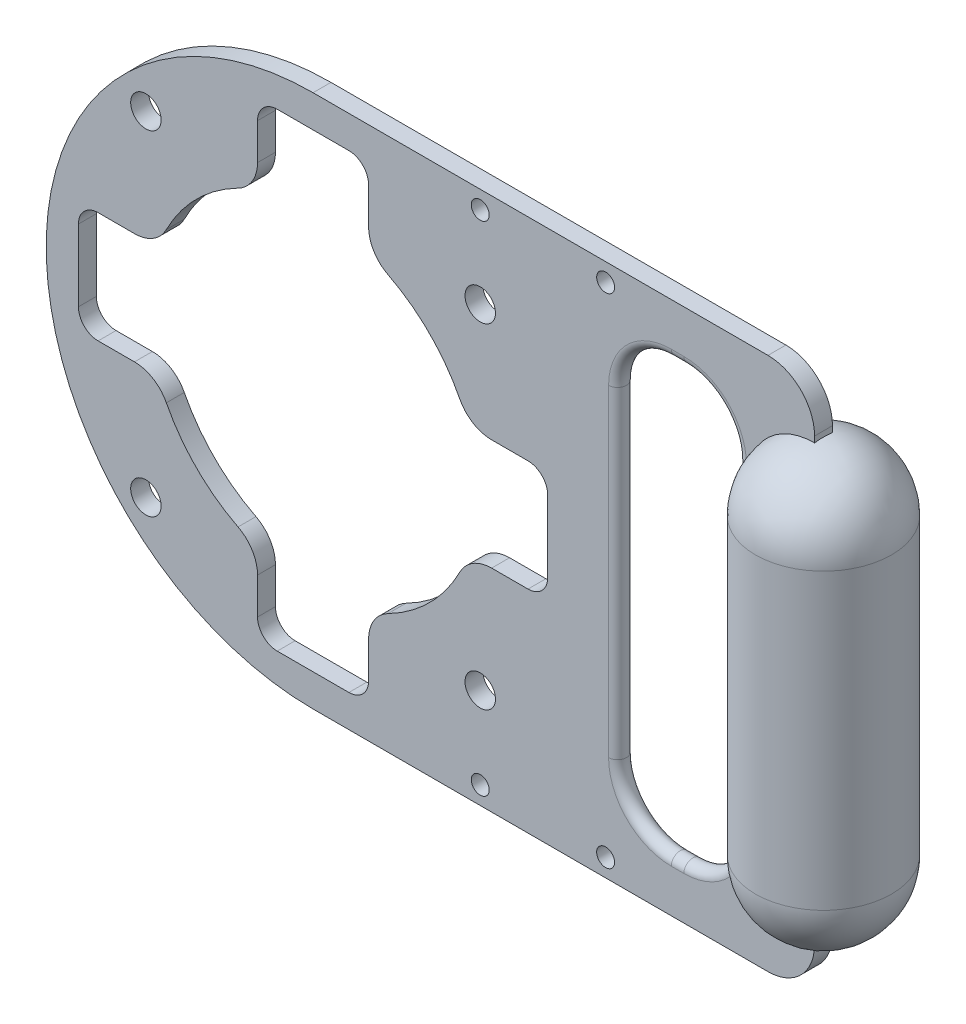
ISO-10303-21;
HEADER;
FILE_DESCRIPTION(('STEP AP214'),'2;1');
FILE_NAME('part.step','',(''),(''),'','','');
FILE_SCHEMA(('AUTOMOTIVE_DESIGN { 1 0 10303 214 1 1 1 1 }'));
ENDSEC;
DATA;
#1=APPLICATION_CONTEXT('core data for automotive mechanical design processes');
#2=APPLICATION_PROTOCOL_DEFINITION('international standard','automotive_design',2000,#1);
#3=PRODUCT_CONTEXT('',#1,'mechanical');
#4=PRODUCT('Part','Part','',(#3));
#5=PRODUCT_RELATED_PRODUCT_CATEGORY('part','',(#4));
#6=PRODUCT_DEFINITION_FORMATION('','',#4);
#7=PRODUCT_DEFINITION_CONTEXT('part definition',#1,'design');
#8=PRODUCT_DEFINITION('design','',#6,#7);
#9=PRODUCT_DEFINITION_SHAPE('','',#8);
#10=(LENGTH_UNIT() NAMED_UNIT(*) SI_UNIT(.MILLI.,.METRE.));
#11=(NAMED_UNIT(*) PLANE_ANGLE_UNIT() SI_UNIT($,.RADIAN.));
#12=(NAMED_UNIT(*) SI_UNIT($,.STERADIAN.) SOLID_ANGLE_UNIT());
#13=UNCERTAINTY_MEASURE_WITH_UNIT(LENGTH_MEASURE(1.E-05),#10,'distance_accuracy_value','');
#14=(GEOMETRIC_REPRESENTATION_CONTEXT(3) GLOBAL_UNCERTAINTY_ASSIGNED_CONTEXT((#13)) GLOBAL_UNIT_ASSIGNED_CONTEXT((#10,
#11,#12)) REPRESENTATION_CONTEXT('',''));
#15=CARTESIAN_POINT('',(0.,0.,0.));
#16=DIRECTION('',(0.,0.,1.));
#17=DIRECTION('',(1.,0.,0.));
#18=AXIS2_PLACEMENT_3D('',#15,#16,#17);
#19=CARTESIAN_POINT('',(140.,41.,2.5));
#20=DIRECTION('',(1.,0.,0.));
#21=DIRECTION('',(0.,1.,0.));
#22=AXIS2_PLACEMENT_3D('',#19,#20,#21);
#23=SPHERICAL_SURFACE('',#22,19.);
#24=CARTESIAN_POINT('',(140.,41.,2.5));
#25=DIRECTION('',(0.,-1.,0.));
#26=DIRECTION('',(1.,0.,0.));
#27=AXIS2_PLACEMENT_3D('',#24,#25,#26);
#28=CIRCLE('',#27,19.);
#29=CARTESIAN_POINT('',(121.165191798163,41.,0.));
#30=VERTEX_POINT('',#29);
#31=CARTESIAN_POINT('',(159.,41.,2.5));
#32=VERTEX_POINT('',#31);
#33=EDGE_CURVE('E1079',#30,#32,#28,.T.);
#34=ORIENTED_EDGE('',*,*,#33,.F.);
#35=CARTESIAN_POINT('',(121.165191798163,41.,0.));
#36=CARTESIAN_POINT('',(121.165192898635,41.318637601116,0.));
#37=CARTESIAN_POINT('',(121.173279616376,41.6372153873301,0.));
#38=CARTESIAN_POINT('',(121.205596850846,42.2735604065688,0.));
#39=CARTESIAN_POINT('',(121.229827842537,42.5913276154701,0.));
#40=CARTESIAN_POINT('',(121.326775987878,43.5431403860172,0.));
#41=CARTESIAN_POINT('',(121.423748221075,44.1748978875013,0.));
#42=CARTESIAN_POINT('',(121.659297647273,45.3184510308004,0.));
#43=CARTESIAN_POINT('',(121.787953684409,45.8323239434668,0.));
#44=CARTESIAN_POINT('',(122.013014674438,46.593606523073,0.));
#45=CARTESIAN_POINT('',(122.093398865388,46.8458250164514,0.));
#46=CARTESIAN_POINT('',(122.264744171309,47.3467150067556,0.));
#47=CARTESIAN_POINT('',(122.355708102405,47.5953855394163,0.));
#48=CARTESIAN_POINT('',(122.644288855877,48.3355098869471,0.));
#49=CARTESIAN_POINT('',(122.857559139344,48.8209564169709,0.));
#50=CARTESIAN_POINT('',(123.324263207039,49.7721403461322,0.));
#51=CARTESIAN_POINT('',(123.577696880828,50.2378777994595,0.));
#52=CARTESIAN_POINT('',(123.986519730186,50.9191047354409,0.));
#53=CARTESIAN_POINT('',(124.127581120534,51.143295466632,0.));
#54=CARTESIAN_POINT('',(124.418990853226,51.5854735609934,0.));
#55=CARTESIAN_POINT('',(124.569336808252,51.8034624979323,0.));
#56=CARTESIAN_POINT('',(125.034000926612,52.4476698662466,0.));
#57=CARTESIAN_POINT('',(125.361966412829,52.8641639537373,0.));
#58=CARTESIAN_POINT('',(126.051693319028,53.6678793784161,0.));
#59=CARTESIAN_POINT('',(126.413445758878,54.0551084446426,0.));
#60=CARTESIAN_POINT('',(127.168275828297,54.797723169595,0.));
#61=CARTESIAN_POINT('',(127.561353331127,55.1531089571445,0.));
#62=CARTESIAN_POINT('',(128.376099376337,55.8295378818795,0.));
#63=CARTESIAN_POINT('',(128.797767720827,56.1505812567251,0.));
#64=CARTESIAN_POINT('',(129.449279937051,56.604564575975,0.));
#65=CARTESIAN_POINT('',(129.669628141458,56.7513007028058,0.));
#66=CARTESIAN_POINT('',(130.116374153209,57.0353992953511,0.));
#67=CARTESIAN_POINT('',(130.342773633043,57.1727591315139,0.));
#68=CARTESIAN_POINT('',(131.030430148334,57.5703694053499,0.));
#69=CARTESIAN_POINT('',(131.500155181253,57.8161575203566,0.));
#70=CARTESIAN_POINT('',(132.458569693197,58.2672327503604,0.));
#71=CARTESIAN_POINT('',(132.947256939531,58.4725246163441,0.));
#72=CARTESIAN_POINT('',(133.792189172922,58.7862691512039,0.));
#73=CARTESIAN_POINT('',(134.144524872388,58.9053524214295,0.));
#74=CARTESIAN_POINT('',(134.855662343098,59.1224718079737,0.));
#75=CARTESIAN_POINT('',(135.214464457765,59.2205068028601,0.));
#76=CARTESIAN_POINT('',(135.937250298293,59.3951708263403,0.));
#77=CARTESIAN_POINT('',(136.301234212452,59.471799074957,0.));
#78=CARTESIAN_POINT('',(137.033565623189,59.6034636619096,0.));
#79=CARTESIAN_POINT('',(137.401918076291,59.6584724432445,0.));
#80=CARTESIAN_POINT('',(138.141234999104,59.7465608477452,0.));
#81=CARTESIAN_POINT('',(138.512199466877,59.7796404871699,0.));
#82=CARTESIAN_POINT('',(139.255442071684,59.8237712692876,0.));
#83=CARTESIAN_POINT('',(139.627720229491,59.834822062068,0.));
#84=CARTESIAN_POINT('',(140.,59.8348082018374,0.));
#85=B_SPLINE_CURVE_WITH_KNOTS('',3,(#35,#36,#37,#38,#39,#40,#41,#42,#43,#44,#45,#46,#47,#48,#49,
#50,#51,#52,#53,#54,#55,#56,#57,#58,#59,#60,#61,#62,#63,#64,#65,#66,#67,#68,#69,#70,#71,#72,#73,
#74,#75,#76,#77,#78,#79,#80,#81,#82,#83,#84),.UNSPECIFIED.,.F.,.F.,(4,2,2,2,2,2,2,2,2,2,2,2,2,2,
2,2,2,2,2,2,2,2,2,2,4),(0.,0.955690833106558,1.91140978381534,3.82523423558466,5.41253371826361,
6.20647504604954,7.00062819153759,8.58930878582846,10.1779850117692,10.9724088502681,
11.7666292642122,13.3549476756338,14.942845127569,16.5307361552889,18.1186161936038,
18.9126196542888,19.7068448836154,21.2952591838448,22.8834870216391,23.99862606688,
25.1138245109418,26.2290635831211,27.3457196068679,28.4623748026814,29.5790477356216),.UNSPECIFIED.);
#86=CARTESIAN_POINT('',(140.,59.8348082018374,0.));
#87=VERTEX_POINT('',#86);
#88=EDGE_CURVE('E1072',#30,#87,#85,.T.);
#89=ORIENTED_EDGE('',*,*,#88,.T.);
#90=CARTESIAN_POINT('',(140.,41.,2.5));
#91=DIRECTION('',(1.,0.,0.));
#92=DIRECTION('',(0.,1.,0.));
#93=AXIS2_PLACEMENT_3D('',#90,#91,#92);
#94=CIRCLE('',#93,19.);
#95=CARTESIAN_POINT('',(140.,59.8348082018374,5.));
#96=VERTEX_POINT('',#95);
#97=EDGE_CURVE('E1103',#87,#96,#94,.T.);
#98=ORIENTED_EDGE('',*,*,#97,.T.);
#99=CARTESIAN_POINT('',(140.,59.8348082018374,5.));
#100=CARTESIAN_POINT('',(139.646831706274,59.8348194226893,5.));
#101=CARTESIAN_POINT('',(139.293664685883,59.82487532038,5.));
#102=CARTESIAN_POINT('',(138.588464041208,59.7851581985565,5.));
#103=CARTESIAN_POINT('',(138.236430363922,59.7553861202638,5.));
#104=CARTESIAN_POINT('',(137.534599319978,59.6760954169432,5.));
#105=CARTESIAN_POINT('',(137.184801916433,59.6265771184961,5.));
#106=CARTESIAN_POINT('',(136.488806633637,59.5079993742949,5.));
#107=CARTESIAN_POINT('',(136.142606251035,59.4389546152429,5.));
#108=CARTESIAN_POINT('',(135.454629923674,59.2815241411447,5.));
#109=CARTESIAN_POINT('',(135.112853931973,59.193138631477,5.));
#110=CARTESIAN_POINT('',(134.434826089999,58.9973160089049,5.));
#111=CARTESIAN_POINT('',(134.098574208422,58.8898790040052,5.));
#112=CARTESIAN_POINT('',(133.265942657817,58.5978045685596,5.));
#113=CARTESIAN_POINT('',(132.773630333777,58.401437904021,5.));
#114=CARTESIAN_POINT('',(131.807222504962,57.9678783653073,5.));
#115=CARTESIAN_POINT('',(131.333129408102,57.7306801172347,5.));
#116=CARTESIAN_POINT('',(130.638365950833,57.3456408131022,5.));
#117=CARTESIAN_POINT('',(130.409493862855,57.2124115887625,5.));
#118=CARTESIAN_POINT('',(129.957632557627,56.9364651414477,5.));
#119=CARTESIAN_POINT('',(129.73464170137,56.7937506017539,5.));
#120=CARTESIAN_POINT('',(129.074953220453,56.3516610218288,5.));
#121=CARTESIAN_POINT('',(128.647499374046,56.0383176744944,5.));
#122=CARTESIAN_POINT('',(127.820566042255,55.3767814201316,5.));
#123=CARTESIAN_POINT('',(127.421086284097,55.0285888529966,5.));
#124=CARTESIAN_POINT('',(126.652858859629,54.2997788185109,5.));
#125=CARTESIAN_POINT('',(126.284111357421,53.9191611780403,5.));
#126=CARTESIAN_POINT('',(125.579921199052,53.1281407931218,5.));
#127=CARTESIAN_POINT('',(125.244485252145,52.7177320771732,5.));
#128=CARTESIAN_POINT('',(124.609387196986,51.8701184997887,5.));
#129=CARTESIAN_POINT('',(124.309724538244,51.4329140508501,5.));
#130=CARTESIAN_POINT('',(123.748250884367,50.534736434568,5.));
#131=CARTESIAN_POINT('',(123.486446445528,50.0737591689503,5.));
#132=CARTESIAN_POINT('',(123.002597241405,49.1313507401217,5.));
#133=CARTESIAN_POINT('',(122.780554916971,48.6499183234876,5.));
#134=CARTESIAN_POINT('',(122.377932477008,47.6703120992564,5.));
#135=CARTESIAN_POINT('',(122.197331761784,47.1721467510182,5.));
#136=CARTESIAN_POINT('',(121.878762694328,46.1624467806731,5.));
#137=CARTESIAN_POINT('',(121.74078409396,45.6509154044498,5.));
#138=CARTESIAN_POINT('',(121.548281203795,44.7953951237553,5.));
#139=CARTESIAN_POINT('',(121.481366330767,44.4541399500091,5.));
#140=CARTESIAN_POINT('',(121.366523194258,43.7684549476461,5.));
#141=CARTESIAN_POINT('',(121.318593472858,43.4240253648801,5.));
#142=CARTESIAN_POINT('',(121.241929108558,42.7335617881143,5.));
#143=CARTESIAN_POINT('',(121.213165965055,42.3875309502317,5.));
#144=CARTESIAN_POINT('',(121.174790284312,41.6943347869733,5.));
#145=CARTESIAN_POINT('',(121.165181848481,41.3471692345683,5.));
#146=CARTESIAN_POINT('',(121.165191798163,41.,5.));
#147=B_SPLINE_CURVE_WITH_KNOTS('',3,(#99,#100,#101,#102,#103,#104,#105,#106,#107,#108,#109,#110,
#111,#112,#113,#114,#115,#116,#117,#118,#119,#120,#121,#122,#123,#124,#125,#126,#127,#128,#129,
#130,#131,#132,#133,#134,#135,#136,#137,#138,#139,#140,#141,#142,#143,#144,#145,#146),
.UNSPECIFIED.,.F.,.F.,(4,2,2,2,2,2,2,2,2,2,2,2,2,2,2,2,2,2,2,2,2,2,2,4),(0.,1.0593629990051,
2.11867571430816,3.17797091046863,4.23647147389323,5.29496079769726,6.35344412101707,
7.9415790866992,9.52992322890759,10.3241934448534,11.1182399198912,12.7061950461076,
14.2941346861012,15.8820828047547,17.4703501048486,19.0585929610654,20.647110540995,
22.2357256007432,23.8235492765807,25.4109908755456,26.4537699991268,27.4964690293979,
28.5376140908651,29.578982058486),.UNSPECIFIED.);
#148=CARTESIAN_POINT('',(121.165191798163,41.,5.));
#149=VERTEX_POINT('',#148);
#150=EDGE_CURVE('E1111',#96,#149,#147,.T.);
#151=ORIENTED_EDGE('',*,*,#150,.T.);
#152=CARTESIAN_POINT('',(140.,41.,2.5));
#153=DIRECTION('',(0.,-1.,0.));
#154=DIRECTION('',(1.,0.,0.));
#155=AXIS2_PLACEMENT_3D('',#152,#153,#154);
#156=CIRCLE('',#155,19.);
#157=EDGE_CURVE('E1068',#32,#149,#156,.T.);
#158=ORIENTED_EDGE('',*,*,#157,.F.);
#159=EDGE_LOOP('',(#34,#89,#98,#151,#158));
#160=FACE_BOUND('',#159,.T.);
#161=ADVANCED_FACE('F14',(#160),#23,.T.);
#162=CARTESIAN_POINT('',(140.,-41.,2.5));
#163=DIRECTION('',(1.,0.,0.));
#164=DIRECTION('',(0.,1.,0.));
#165=AXIS2_PLACEMENT_3D('',#162,#163,#164);
#166=SPHERICAL_SURFACE('',#165,19.);
#167=CARTESIAN_POINT('',(140.,-41.,2.5));
#168=DIRECTION('',(1.,0.,0.));
#169=DIRECTION('',(0.,1.,0.));
#170=AXIS2_PLACEMENT_3D('',#167,#168,#169);
#171=CIRCLE('',#170,19.);
#172=CARTESIAN_POINT('',(140.,-59.8348082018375,5.));
#173=VERTEX_POINT('',#172);
#174=CARTESIAN_POINT('',(140.,-59.8348082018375,0.));
#175=VERTEX_POINT('',#174);
#176=EDGE_CURVE('E922',#173,#175,#171,.T.);
#177=ORIENTED_EDGE('',*,*,#176,.T.);
#178=CARTESIAN_POINT('',(140.,-59.8348082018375,0.));
#179=CARTESIAN_POINT('',(139.646831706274,-59.8348194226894,0.));
#180=CARTESIAN_POINT('',(139.293664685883,-59.82487532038,0.));
#181=CARTESIAN_POINT('',(138.588464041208,-59.7851581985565,0.));
#182=CARTESIAN_POINT('',(138.236430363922,-59.7553861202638,0.));
#183=CARTESIAN_POINT('',(137.534599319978,-59.6760954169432,0.));
#184=CARTESIAN_POINT('',(137.184801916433,-59.6265771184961,0.));
#185=CARTESIAN_POINT('',(136.488806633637,-59.5079993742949,0.));
#186=CARTESIAN_POINT('',(136.142606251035,-59.4389546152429,0.));
#187=CARTESIAN_POINT('',(135.454629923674,-59.2815241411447,0.));
#188=CARTESIAN_POINT('',(135.112853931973,-59.193138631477,0.));
#189=CARTESIAN_POINT('',(134.434826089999,-58.997316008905,0.));
#190=CARTESIAN_POINT('',(134.098574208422,-58.8898790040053,0.));
#191=CARTESIAN_POINT('',(133.265942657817,-58.5978045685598,0.));
#192=CARTESIAN_POINT('',(132.773630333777,-58.401437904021,0.));
#193=CARTESIAN_POINT('',(131.807222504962,-57.9678783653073,0.));
#194=CARTESIAN_POINT('',(131.333129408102,-57.7306801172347,0.));
#195=CARTESIAN_POINT('',(130.638365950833,-57.3456408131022,0.));
#196=CARTESIAN_POINT('',(130.409493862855,-57.2124115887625,0.));
#197=CARTESIAN_POINT('',(129.957632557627,-56.9364651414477,0.));
#198=CARTESIAN_POINT('',(129.73464170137,-56.7937506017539,0.));
#199=CARTESIAN_POINT('',(129.074953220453,-56.3516610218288,0.));
#200=CARTESIAN_POINT('',(128.647499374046,-56.0383176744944,0.));
#201=CARTESIAN_POINT('',(127.820566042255,-55.3767814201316,0.));
#202=CARTESIAN_POINT('',(127.421086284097,-55.0285888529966,0.));
#203=CARTESIAN_POINT('',(126.652858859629,-54.2997788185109,0.));
#204=CARTESIAN_POINT('',(126.284111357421,-53.9191611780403,0.));
#205=CARTESIAN_POINT('',(125.579921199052,-53.1281407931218,0.));
#206=CARTESIAN_POINT('',(125.244485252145,-52.7177320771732,0.));
#207=CARTESIAN_POINT('',(124.609387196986,-51.8701184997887,0.));
#208=CARTESIAN_POINT('',(124.309724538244,-51.4329140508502,0.));
#209=CARTESIAN_POINT('',(123.748250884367,-50.534736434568,0.));
#210=CARTESIAN_POINT('',(123.486446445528,-50.0737591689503,0.));
#211=CARTESIAN_POINT('',(123.002597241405,-49.1313507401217,0.));
#212=CARTESIAN_POINT('',(122.780554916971,-48.6499183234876,0.));
#213=CARTESIAN_POINT('',(122.377932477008,-47.6703120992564,0.));
#214=CARTESIAN_POINT('',(122.197331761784,-47.1721467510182,0.));
#215=CARTESIAN_POINT('',(121.878762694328,-46.1624467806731,0.));
#216=CARTESIAN_POINT('',(121.74078409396,-45.6509154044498,0.));
#217=CARTESIAN_POINT('',(121.548281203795,-44.7953951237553,0.));
#218=CARTESIAN_POINT('',(121.481366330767,-44.4541399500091,0.));
#219=CARTESIAN_POINT('',(121.366523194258,-43.7684549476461,0.));
#220=CARTESIAN_POINT('',(121.318593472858,-43.4240253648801,0.));
#221=CARTESIAN_POINT('',(121.241929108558,-42.7335617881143,0.));
#222=CARTESIAN_POINT('',(121.213165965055,-42.3875309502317,0.));
#223=CARTESIAN_POINT('',(121.174790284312,-41.6943347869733,0.));
#224=CARTESIAN_POINT('',(121.165181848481,-41.3471692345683,0.));
#225=CARTESIAN_POINT('',(121.165191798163,-41.,0.));
#226=B_SPLINE_CURVE_WITH_KNOTS('',3,(#178,#179,#180,#181,#182,#183,#184,#185,#186,#187,#188,
#189,#190,#191,#192,#193,#194,#195,#196,#197,#198,#199,#200,#201,#202,#203,#204,#205,#206,#207,
#208,#209,#210,#211,#212,#213,#214,#215,#216,#217,#218,#219,#220,#221,#222,#223,#224,#225),
.UNSPECIFIED.,.F.,.F.,(4,2,2,2,2,2,2,2,2,2,2,2,2,2,2,2,2,2,2,2,2,2,2,4),(0.,1.05936299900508,
2.11867571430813,3.1779709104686,4.23647147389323,5.29496079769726,6.35344412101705,
7.94157908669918,9.52992322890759,10.3241934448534,11.1182399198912,12.7061950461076,
14.2941346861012,15.8820828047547,17.4703501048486,19.0585929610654,20.647110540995,
22.2357256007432,23.8235492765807,25.4109908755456,26.4537699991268,27.4964690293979,
28.5376140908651,29.578982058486),.UNSPECIFIED.);
#227=CARTESIAN_POINT('',(121.165191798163,-41.,0.));
#228=VERTEX_POINT('',#227);
#229=EDGE_CURVE('E36',#175,#228,#226,.T.);
#230=ORIENTED_EDGE('',*,*,#229,.T.);
#231=CARTESIAN_POINT('',(140.,-41.,2.5));
#232=DIRECTION('',(0.,-1.,0.));
#233=DIRECTION('',(1.,0.,0.));
#234=AXIS2_PLACEMENT_3D('',#231,#232,#233);
#235=CIRCLE('',#234,19.);
#236=CARTESIAN_POINT('',(159.,-41.,2.5));
#237=VERTEX_POINT('',#236);
#238=EDGE_CURVE('E27',#237,#228,#235,.F.);
#239=ORIENTED_EDGE('',*,*,#238,.F.);
#240=CARTESIAN_POINT('',(140.,-41.,2.5));
#241=DIRECTION('',(0.,-1.,0.));
#242=DIRECTION('',(1.,0.,0.));
#243=AXIS2_PLACEMENT_3D('',#240,#241,#242);
#244=CIRCLE('',#243,19.);
#245=CARTESIAN_POINT('',(121.165191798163,-41.,5.));
#246=VERTEX_POINT('',#245);
#247=EDGE_CURVE('E1071',#246,#237,#244,.F.);
#248=ORIENTED_EDGE('',*,*,#247,.F.);
#249=CARTESIAN_POINT('',(121.165191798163,-41.,5.));
#250=CARTESIAN_POINT('',(121.165192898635,-41.318637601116,5.));
#251=CARTESIAN_POINT('',(121.173279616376,-41.6372153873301,5.));
#252=CARTESIAN_POINT('',(121.205596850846,-42.2735604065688,5.));
#253=CARTESIAN_POINT('',(121.229827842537,-42.5913276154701,5.));
#254=CARTESIAN_POINT('',(121.326775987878,-43.5431403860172,5.));
#255=CARTESIAN_POINT('',(121.423748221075,-44.1748978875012,5.));
#256=CARTESIAN_POINT('',(121.659297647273,-45.3184510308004,5.));
#257=CARTESIAN_POINT('',(121.787953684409,-45.8323239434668,5.));
#258=CARTESIAN_POINT('',(122.013014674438,-46.5936065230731,5.));
#259=CARTESIAN_POINT('',(122.093398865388,-46.8458250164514,5.));
#260=CARTESIAN_POINT('',(122.264744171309,-47.3467150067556,5.));
#261=CARTESIAN_POINT('',(122.355708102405,-47.5953855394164,5.));
#262=CARTESIAN_POINT('',(122.644288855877,-48.3355098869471,5.));
#263=CARTESIAN_POINT('',(122.857559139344,-48.820956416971,5.));
#264=CARTESIAN_POINT('',(123.324263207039,-49.7721403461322,5.));
#265=CARTESIAN_POINT('',(123.577696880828,-50.2378777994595,5.));
#266=CARTESIAN_POINT('',(123.986519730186,-50.9191047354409,5.));
#267=CARTESIAN_POINT('',(124.127581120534,-51.143295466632,5.));
#268=CARTESIAN_POINT('',(124.418990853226,-51.5854735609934,5.));
#269=CARTESIAN_POINT('',(124.569336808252,-51.8034624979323,5.));
#270=CARTESIAN_POINT('',(125.034000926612,-52.4476698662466,5.));
#271=CARTESIAN_POINT('',(125.361966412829,-52.8641639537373,5.));
#272=CARTESIAN_POINT('',(126.051693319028,-53.6678793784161,5.));
#273=CARTESIAN_POINT('',(126.413445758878,-54.0551084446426,5.));
#274=CARTESIAN_POINT('',(127.168275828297,-54.797723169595,5.));
#275=CARTESIAN_POINT('',(127.561353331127,-55.1531089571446,5.));
#276=CARTESIAN_POINT('',(128.376099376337,-55.8295378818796,5.));
#277=CARTESIAN_POINT('',(128.797767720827,-56.1505812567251,5.));
#278=CARTESIAN_POINT('',(129.449279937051,-56.6045645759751,5.));
#279=CARTESIAN_POINT('',(129.669628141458,-56.7513007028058,5.));
#280=CARTESIAN_POINT('',(130.116374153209,-57.0353992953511,5.));
#281=CARTESIAN_POINT('',(130.342773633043,-57.172759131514,5.));
#282=CARTESIAN_POINT('',(131.030430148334,-57.57036940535,5.));
#283=CARTESIAN_POINT('',(131.500155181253,-57.8161575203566,5.));
#284=CARTESIAN_POINT('',(132.458569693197,-58.2672327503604,5.));
#285=CARTESIAN_POINT('',(132.947256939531,-58.4725246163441,5.));
#286=CARTESIAN_POINT('',(133.792189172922,-58.7862691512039,5.));
#287=CARTESIAN_POINT('',(134.144524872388,-58.9053524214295,5.));
#288=CARTESIAN_POINT('',(134.855662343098,-59.1224718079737,5.));
#289=CARTESIAN_POINT('',(135.214464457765,-59.2205068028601,5.));
#290=CARTESIAN_POINT('',(135.937250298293,-59.3951708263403,5.));
#291=CARTESIAN_POINT('',(136.301234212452,-59.471799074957,5.));
#292=CARTESIAN_POINT('',(137.033565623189,-59.6034636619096,5.));
#293=CARTESIAN_POINT('',(137.401918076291,-59.6584724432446,5.));
#294=CARTESIAN_POINT('',(138.141234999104,-59.7465608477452,5.));
#295=CARTESIAN_POINT('',(138.512199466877,-59.7796404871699,5.));
#296=CARTESIAN_POINT('',(139.255442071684,-59.8237712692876,5.));
#297=CARTESIAN_POINT('',(139.627720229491,-59.8348220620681,5.));
#298=CARTESIAN_POINT('',(140.,-59.8348082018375,5.));
#299=B_SPLINE_CURVE_WITH_KNOTS('',3,(#249,#250,#251,#252,#253,#254,#255,#256,#257,#258,#259,
#260,#261,#262,#263,#264,#265,#266,#267,#268,#269,#270,#271,#272,#273,#274,#275,#276,#277,#278,
#279,#280,#281,#282,#283,#284,#285,#286,#287,#288,#289,#290,#291,#292,#293,#294,#295,#296,#297,
#298),.UNSPECIFIED.,.F.,.F.,(4,2,2,2,2,2,2,2,2,2,2,2,2,2,2,2,2,2,2,2,2,2,2,2,4),(0.,
0.955690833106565,1.91140978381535,3.82523423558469,5.41253371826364,6.20647504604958,
7.00062819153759,8.58930878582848,10.1779850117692,10.972408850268,11.7666292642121,
13.3549476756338,14.942845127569,16.5307361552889,18.1186161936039,18.9126196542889,
19.7068448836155,21.2952591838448,22.8834870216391,23.99862606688,25.1138245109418,
26.2290635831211,27.3457196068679,28.4623748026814,29.5790477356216),.UNSPECIFIED.);
#300=EDGE_CURVE('E1105',#246,#173,#299,.T.);
#301=ORIENTED_EDGE('',*,*,#300,.T.);
#302=EDGE_LOOP('',(#177,#230,#239,#248,#301));
#303=FACE_BOUND('',#302,.T.);
#304=ADVANCED_FACE('F1046',(#303),#166,.T.);
#305=CARTESIAN_POINT('',(140.,60.,2.5));
#306=DIRECTION('',(0.,-1.,0.));
#307=DIRECTION('',(1.,0.,0.));
#308=AXIS2_PLACEMENT_3D('',#305,#306,#307);
#309=CYLINDRICAL_SURFACE('',#308,19.);
#310=ORIENTED_EDGE('',*,*,#238,.T.);
#311=DIRECTION('',(0.,-1.,0.));
#312=VECTOR('',#311,1.);
#313=CARTESIAN_POINT('',(121.165191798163,60.,0.));
#314=LINE('',#313,#312);
#315=EDGE_CURVE('E9',#228,#30,#314,.F.);
#316=ORIENTED_EDGE('',*,*,#315,.T.);
#317=ORIENTED_EDGE('',*,*,#33,.T.);
#318=ORIENTED_EDGE('',*,*,#157,.T.);
#319=DIRECTION('',(0.,-1.,0.));
#320=VECTOR('',#319,1.);
#321=CARTESIAN_POINT('',(121.165191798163,60.,5.));
#322=LINE('',#321,#320);
#323=EDGE_CURVE('E1070',#149,#246,#322,.T.);
#324=ORIENTED_EDGE('',*,*,#323,.T.);
#325=ORIENTED_EDGE('',*,*,#247,.T.);
#326=EDGE_LOOP('',(#310,#316,#317,#318,#324,#325));
#327=FACE_BOUND('',#326,.T.);
#328=ADVANCED_FACE('F1052',(#327),#309,.T.);
#329=CARTESIAN_POINT('',(46.6690475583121,-69.5,5.));
#330=DIRECTION('',(0.,0.,1.));
#331=DIRECTION('',(0.,1.,0.));
#332=AXIS2_PLACEMENT_3D('',#329,#330,#331);
#333=CYLINDRICAL_SURFACE('',#332,2.5);
#334=CARTESIAN_POINT('',(46.6690475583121,-69.5,0.));
#335=DIRECTION('',(0.,0.,1.));
#336=DIRECTION('',(0.,1.,0.));
#337=AXIS2_PLACEMENT_3D('',#334,#335,#336);
#338=CIRCLE('',#337,2.5);
#339=CARTESIAN_POINT('',(46.6690475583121,-67.,0.));
#340=VERTEX_POINT('',#339);
#341=EDGE_CURVE('E605',#340,#340,#338,.F.);
#342=ORIENTED_EDGE('',*,*,#341,.T.);
#343=EDGE_LOOP('',(#342));
#344=FACE_BOUND('',#343,.T.);
#345=CARTESIAN_POINT('',(46.6690475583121,-69.5,5.));
#346=DIRECTION('',(0.,0.,1.));
#347=DIRECTION('',(0.,1.,0.));
#348=AXIS2_PLACEMENT_3D('',#345,#346,#347);
#349=CIRCLE('',#348,2.5);
#350=CARTESIAN_POINT('',(46.6690475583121,-67.,5.));
#351=VERTEX_POINT('',#350);
#352=EDGE_CURVE('E683',#351,#351,#349,.F.);
#353=ORIENTED_EDGE('',*,*,#352,.F.);
#354=EDGE_LOOP('',(#353));
#355=FACE_BOUND('',#354,.T.);
#356=ADVANCED_FACE('F1089',(#344,#355),#333,.F.);
#357=CARTESIAN_POINT('',(81.6690475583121,-69.5,5.));
#358=DIRECTION('',(0.,0.,1.));
#359=DIRECTION('',(0.,1.,0.));
#360=AXIS2_PLACEMENT_3D('',#357,#358,#359);
#361=CYLINDRICAL_SURFACE('',#360,2.5);
#362=CARTESIAN_POINT('',(81.6690475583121,-69.5,0.));
#363=DIRECTION('',(0.,0.,1.));
#364=DIRECTION('',(0.,1.,0.));
#365=AXIS2_PLACEMENT_3D('',#362,#363,#364);
#366=CIRCLE('',#365,2.5);
#367=CARTESIAN_POINT('',(81.6690475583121,-67.,0.));
#368=VERTEX_POINT('',#367);
#369=EDGE_CURVE('E602',#368,#368,#366,.F.);
#370=ORIENTED_EDGE('',*,*,#369,.T.);
#371=EDGE_LOOP('',(#370));
#372=FACE_BOUND('',#371,.T.);
#373=CARTESIAN_POINT('',(81.6690475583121,-69.5,5.));
#374=DIRECTION('',(0.,0.,1.));
#375=DIRECTION('',(0.,1.,0.));
#376=AXIS2_PLACEMENT_3D('',#373,#374,#375);
#377=CIRCLE('',#376,2.5);
#378=CARTESIAN_POINT('',(81.6690475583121,-67.,5.));
#379=VERTEX_POINT('',#378);
#380=EDGE_CURVE('E680',#379,#379,#377,.F.);
#381=ORIENTED_EDGE('',*,*,#380,.F.);
#382=EDGE_LOOP('',(#381));
#383=FACE_BOUND('',#382,.T.);
#384=ADVANCED_FACE('F1094',(#372,#383),#361,.F.);
#385=CARTESIAN_POINT('',(81.6690475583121,69.5,5.));
#386=DIRECTION('',(0.,0.,1.));
#387=DIRECTION('',(0.,1.,0.));
#388=AXIS2_PLACEMENT_3D('',#385,#386,#387);
#389=CYLINDRICAL_SURFACE('',#388,2.5);
#390=CARTESIAN_POINT('',(81.6690475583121,69.5,0.));
#391=DIRECTION('',(0.,0.,1.));
#392=DIRECTION('',(0.,1.,0.));
#393=AXIS2_PLACEMENT_3D('',#390,#391,#392);
#394=CIRCLE('',#393,2.5);
#395=CARTESIAN_POINT('',(81.6690475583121,72.,0.));
#396=VERTEX_POINT('',#395);
#397=EDGE_CURVE('E599',#396,#396,#394,.F.);
#398=ORIENTED_EDGE('',*,*,#397,.T.);
#399=EDGE_LOOP('',(#398));
#400=FACE_BOUND('',#399,.T.);
#401=CARTESIAN_POINT('',(81.6690475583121,69.5,5.));
#402=DIRECTION('',(0.,0.,1.));
#403=DIRECTION('',(0.,1.,0.));
#404=AXIS2_PLACEMENT_3D('',#401,#402,#403);
#405=CIRCLE('',#404,2.5);
#406=CARTESIAN_POINT('',(81.6690475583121,72.,5.));
#407=VERTEX_POINT('',#406);
#408=EDGE_CURVE('E677',#407,#407,#405,.F.);
#409=ORIENTED_EDGE('',*,*,#408,.F.);
#410=EDGE_LOOP('',(#409));
#411=FACE_BOUND('',#410,.T.);
#412=ADVANCED_FACE('F1547',(#400,#411),#389,.F.);
#413=CARTESIAN_POINT('',(46.6690475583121,69.5,5.));
#414=DIRECTION('',(0.,0.,1.));
#415=DIRECTION('',(0.,1.,0.));
#416=AXIS2_PLACEMENT_3D('',#413,#414,#415);
#417=CYLINDRICAL_SURFACE('',#416,2.5);
#418=CARTESIAN_POINT('',(46.6690475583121,69.5,0.));
#419=DIRECTION('',(0.,0.,1.));
#420=DIRECTION('',(0.,1.,0.));
#421=AXIS2_PLACEMENT_3D('',#418,#419,#420);
#422=CIRCLE('',#421,2.5);
#423=CARTESIAN_POINT('',(46.6690475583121,72.,0.));
#424=VERTEX_POINT('',#423);
#425=EDGE_CURVE('E596',#424,#424,#422,.F.);
#426=ORIENTED_EDGE('',*,*,#425,.T.);
#427=EDGE_LOOP('',(#426));
#428=FACE_BOUND('',#427,.T.);
#429=CARTESIAN_POINT('',(46.6690475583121,69.5,5.));
#430=DIRECTION('',(0.,0.,1.));
#431=DIRECTION('',(0.,1.,0.));
#432=AXIS2_PLACEMENT_3D('',#429,#430,#431);
#433=CIRCLE('',#432,2.5);
#434=CARTESIAN_POINT('',(46.6690475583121,72.,5.));
#435=VERTEX_POINT('',#434);
#436=EDGE_CURVE('E356',#435,#435,#433,.F.);
#437=ORIENTED_EDGE('',*,*,#436,.F.);
#438=EDGE_LOOP('',(#437));
#439=FACE_BOUND('',#438,.T.);
#440=ADVANCED_FACE('F1538',(#428,#439),#417,.F.);
#441=CARTESIAN_POINT('',(-60.,10.,-0.00100000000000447));
#442=DIRECTION('',(0.,0.,1.));
#443=DIRECTION('',(0.,1.,0.));
#444=AXIS2_PLACEMENT_3D('',#441,#442,#443);
#445=CYLINDRICAL_SURFACE('',#444,5.5);
#446=DIRECTION('',(0.,0.,1.));
#447=VECTOR('',#446,1.);
#448=CARTESIAN_POINT('',(-60.,15.5,-0.00100000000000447));
#449=LINE('',#448,#447);
#450=CARTESIAN_POINT('',(-60.,15.5,5.));
#451=VERTEX_POINT('',#450);
#452=CARTESIAN_POINT('',(-60.,15.5,0.));
#453=VERTEX_POINT('',#452);
#454=EDGE_CURVE('E629',#451,#453,#449,.F.);
#455=ORIENTED_EDGE('',*,*,#454,.F.);
#456=CARTESIAN_POINT('',(-60.,10.,5.));
#457=DIRECTION('',(0.,0.,1.));
#458=DIRECTION('',(0.,1.,0.));
#459=AXIS2_PLACEMENT_3D('',#456,#457,#458);
#460=CIRCLE('',#459,5.5);
#461=CARTESIAN_POINT('',(-65.5,10.,5.));
#462=VERTEX_POINT('',#461);
#463=EDGE_CURVE('E352',#462,#451,#460,.F.);
#464=ORIENTED_EDGE('',*,*,#463,.F.);
#465=DIRECTION('',(0.,0.,1.));
#466=VECTOR('',#465,1.);
#467=CARTESIAN_POINT('',(-65.5,10.,-0.00100000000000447));
#468=LINE('',#467,#466);
#469=CARTESIAN_POINT('',(-65.5,10.,0.));
#470=VERTEX_POINT('',#469);
#471=EDGE_CURVE('E454',#470,#462,#468,.T.);
#472=ORIENTED_EDGE('',*,*,#471,.F.);
#473=CARTESIAN_POINT('',(-60.,10.,0.));
#474=DIRECTION('',(0.,0.,1.));
#475=DIRECTION('',(0.,1.,0.));
#476=AXIS2_PLACEMENT_3D('',#473,#474,#475);
#477=CIRCLE('',#476,5.5);
#478=EDGE_CURVE('E525',#470,#453,#477,.F.);
#479=ORIENTED_EDGE('',*,*,#478,.T.);
#480=EDGE_LOOP('',(#455,#464,#472,#479));
#481=FACE_BOUND('',#480,.T.);
#482=ADVANCED_FACE('F1529',(#481),#445,.F.);
#483=CARTESIAN_POINT('',(0.,15.5,-0.00100000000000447));
#484=DIRECTION('',(0.,1.,0.));
#485=DIRECTION('',(-1.,0.,0.));
#486=AXIS2_PLACEMENT_3D('',#483,#484,#485);
#487=PLANE('',#486);
#488=DIRECTION('',(0.,0.,-1.));
#489=VECTOR('',#488,1.);
#490=CARTESIAN_POINT('',(-49.8572963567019,15.5,5.));
#491=LINE('',#490,#489);
#492=CARTESIAN_POINT('',(-49.8572963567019,15.5,5.));
#493=VERTEX_POINT('',#492);
#494=CARTESIAN_POINT('',(-49.8572963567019,15.5,0.));
#495=VERTEX_POINT('',#494);
#496=EDGE_CURVE('E344',#493,#495,#491,.T.);
#497=ORIENTED_EDGE('',*,*,#496,.F.);
#498=DIRECTION('',(-1.,0.,0.));
#499=VECTOR('',#498,1.);
#500=CARTESIAN_POINT('',(0.,15.5,5.));
#501=LINE('',#500,#499);
#502=EDGE_CURVE('E347',#451,#493,#501,.F.);
#503=ORIENTED_EDGE('',*,*,#502,.F.);
#504=ORIENTED_EDGE('',*,*,#454,.T.);
#505=DIRECTION('',(-1.,0.,0.));
#506=VECTOR('',#505,1.);
#507=CARTESIAN_POINT('',(0.,15.5,0.));
#508=LINE('',#507,#506);
#509=EDGE_CURVE('E360',#453,#495,#508,.F.);
#510=ORIENTED_EDGE('',*,*,#509,.T.);
#511=EDGE_LOOP('',(#497,#503,#504,#510));
#512=FACE_BOUND('',#511,.T.);
#513=ADVANCED_FACE('F359',(#512),#487,.F.);
#514=CARTESIAN_POINT('',(-49.8572963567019,25.5,5.));
#515=DIRECTION('',(0.,0.,-1.));
#516=DIRECTION('',(0.,-1.,0.));
#517=AXIS2_PLACEMENT_3D('',#514,#515,#516);
#518=CYLINDRICAL_SURFACE('',#517,10.);
#519=CARTESIAN_POINT('',(-49.8572963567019,25.5,5.));
#520=DIRECTION('',(0.,0.,-1.));
#521=DIRECTION('',(0.,-1.,0.));
#522=AXIS2_PLACEMENT_3D('',#519,#520,#521);
#523=CIRCLE('',#522,10.);
#524=CARTESIAN_POINT('',(-40.9542077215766,20.9464285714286,5.));
#525=VERTEX_POINT('',#524);
#526=EDGE_CURVE('E337',#525,#493,#523,.T.);
#527=ORIENTED_EDGE('',*,*,#526,.T.);
#528=ORIENTED_EDGE('',*,*,#496,.T.);
#529=CARTESIAN_POINT('',(-49.8572963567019,25.5,0.));
#530=DIRECTION('',(0.,0.,-1.));
#531=DIRECTION('',(0.,-1.,0.));
#532=AXIS2_PLACEMENT_3D('',#529,#530,#531);
#533=CIRCLE('',#532,10.);
#534=CARTESIAN_POINT('',(-40.9542077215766,20.9464285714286,0.));
#535=VERTEX_POINT('',#534);
#536=EDGE_CURVE('E594',#495,#535,#533,.F.);
#537=ORIENTED_EDGE('',*,*,#536,.T.);
#538=DIRECTION('',(0.,0.,-1.));
#539=VECTOR('',#538,1.);
#540=CARTESIAN_POINT('',(-40.9542077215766,20.9464285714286,5.));
#541=LINE('',#540,#539);
#542=EDGE_CURVE('E346',#535,#525,#541,.F.);
#543=ORIENTED_EDGE('',*,*,#542,.T.);
#544=EDGE_LOOP('',(#527,#528,#537,#543));
#545=FACE_BOUND('',#544,.T.);
#546=ADVANCED_FACE('F341',(#545),#518,.T.);
#547=CARTESIAN_POINT('',(0.,0.,5.));
#548=DIRECTION('',(0.,0.,-1.));
#549=DIRECTION('',(0.,-1.,0.));
#550=AXIS2_PLACEMENT_3D('',#547,#548,#549);
#551=CYLINDRICAL_SURFACE('',#550,46.);
#552=ORIENTED_EDGE('',*,*,#542,.F.);
#553=CARTESIAN_POINT('',(0.,0.,0.));
#554=DIRECTION('',(0.,0.,-1.));
#555=DIRECTION('',(0.,-1.,0.));
#556=AXIS2_PLACEMENT_3D('',#553,#554,#555);
#557=CIRCLE('',#556,46.);
#558=CARTESIAN_POINT('',(-20.9464285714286,40.9542077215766,0.));
#559=VERTEX_POINT('',#558);
#560=EDGE_CURVE('E591',#535,#559,#557,.T.);
#561=ORIENTED_EDGE('',*,*,#560,.T.);
#562=DIRECTION('',(0.,0.,-1.));
#563=VECTOR('',#562,1.);
#564=CARTESIAN_POINT('',(-20.9464285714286,40.9542077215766,5.));
#565=LINE('',#564,#563);
#566=CARTESIAN_POINT('',(-20.9464285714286,40.9542077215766,5.));
#567=VERTEX_POINT('',#566);
#568=EDGE_CURVE('E673',#567,#559,#565,.T.);
#569=ORIENTED_EDGE('',*,*,#568,.F.);
#570=CARTESIAN_POINT('',(0.,0.,5.));
#571=DIRECTION('',(0.,0.,-1.));
#572=DIRECTION('',(0.,-1.,0.));
#573=AXIS2_PLACEMENT_3D('',#570,#571,#572);
#574=CIRCLE('',#573,46.);
#575=EDGE_CURVE('E362',#525,#567,#574,.T.);
#576=ORIENTED_EDGE('',*,*,#575,.F.);
#577=EDGE_LOOP('',(#552,#561,#569,#576));
#578=FACE_BOUND('',#577,.T.);
#579=ADVANCED_FACE('F889',(#578),#551,.F.);
#580=CARTESIAN_POINT('',(-25.5,49.8572963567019,5.));
#581=DIRECTION('',(0.,0.,-1.));
#582=DIRECTION('',(0.,-1.,0.));
#583=AXIS2_PLACEMENT_3D('',#580,#581,#582);
#584=CYLINDRICAL_SURFACE('',#583,10.);
#585=CARTESIAN_POINT('',(-25.5,49.8572963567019,5.));
#586=DIRECTION('',(0.,0.,-1.));
#587=DIRECTION('',(0.,-1.,0.));
#588=AXIS2_PLACEMENT_3D('',#585,#586,#587);
#589=CIRCLE('',#588,10.);
#590=CARTESIAN_POINT('',(-15.5,49.8572963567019,5.));
#591=VERTEX_POINT('',#590);
#592=EDGE_CURVE('E671',#591,#567,#589,.T.);
#593=ORIENTED_EDGE('',*,*,#592,.T.);
#594=ORIENTED_EDGE('',*,*,#568,.T.);
#595=CARTESIAN_POINT('',(-25.5,49.8572963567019,0.));
#596=DIRECTION('',(0.,0.,-1.));
#597=DIRECTION('',(0.,-1.,0.));
#598=AXIS2_PLACEMENT_3D('',#595,#596,#597);
#599=CIRCLE('',#598,10.);
#600=CARTESIAN_POINT('',(-15.5,49.8572963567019,0.));
#601=VERTEX_POINT('',#600);
#602=EDGE_CURVE('E588',#559,#601,#599,.F.);
#603=ORIENTED_EDGE('',*,*,#602,.T.);
#604=DIRECTION('',(0.,0.,1.));
#605=VECTOR('',#604,1.);
#606=CARTESIAN_POINT('',(-15.5,49.8572963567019,-0.00100000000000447));
#607=LINE('',#606,#605);
#608=EDGE_CURVE('E498',#601,#591,#607,.T.);
#609=ORIENTED_EDGE('',*,*,#608,.T.);
#610=EDGE_LOOP('',(#593,#594,#603,#609));
#611=FACE_BOUND('',#610,.T.);
#612=ADVANCED_FACE('F879',(#611),#584,.T.);
#613=CARTESIAN_POINT('',(-15.5,0.,-0.00100000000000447));
#614=DIRECTION('',(-1.,0.,0.));
#615=DIRECTION('',(0.,-1.,0.));
#616=AXIS2_PLACEMENT_3D('',#613,#614,#615);
#617=PLANE('',#616);
#618=ORIENTED_EDGE('',*,*,#608,.F.);
#619=DIRECTION('',(0.,1.,0.));
#620=VECTOR('',#619,1.);
#621=CARTESIAN_POINT('',(-15.5,0.,0.));
#622=LINE('',#621,#620);
#623=CARTESIAN_POINT('',(-15.5,60.,0.));
#624=VERTEX_POINT('',#623);
#625=EDGE_CURVE('E587',#601,#624,#622,.T.);
#626=ORIENTED_EDGE('',*,*,#625,.T.);
#627=DIRECTION('',(0.,0.,1.));
#628=VECTOR('',#627,1.);
#629=CARTESIAN_POINT('',(-15.5,60.,-0.00100000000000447));
#630=LINE('',#629,#628);
#631=CARTESIAN_POINT('',(-15.5,60.,5.));
#632=VERTEX_POINT('',#631);
#633=EDGE_CURVE('E497',#624,#632,#630,.T.);
#634=ORIENTED_EDGE('',*,*,#633,.T.);
#635=DIRECTION('',(0.,-1.,0.));
#636=VECTOR('',#635,1.);
#637=CARTESIAN_POINT('',(-15.5,0.,5.));
#638=LINE('',#637,#636);
#639=EDGE_CURVE('E495',#591,#632,#638,.F.);
#640=ORIENTED_EDGE('',*,*,#639,.F.);
#641=EDGE_LOOP('',(#618,#626,#634,#640));
#642=FACE_BOUND('',#641,.T.);
#643=ADVANCED_FACE('F893',(#642),#617,.F.);
#644=CARTESIAN_POINT('',(-10.,60.,-0.00100000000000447));
#645=DIRECTION('',(0.,0.,1.));
#646=DIRECTION('',(0.,1.,0.));
#647=AXIS2_PLACEMENT_3D('',#644,#645,#646);
#648=CYLINDRICAL_SURFACE('',#647,5.5);
#649=DIRECTION('',(0.,0.,-1.));
#650=VECTOR('',#649,1.);
#651=CARTESIAN_POINT('',(-10.,65.5,-0.00100000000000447));
#652=LINE('',#651,#650);
#653=CARTESIAN_POINT('',(-10.,65.5,0.));
#654=VERTEX_POINT('',#653);
#655=CARTESIAN_POINT('',(-10.,65.5,5.));
#656=VERTEX_POINT('',#655);
#657=EDGE_CURVE('E494',#654,#656,#652,.F.);
#658=ORIENTED_EDGE('',*,*,#657,.T.);
#659=CARTESIAN_POINT('',(-10.,60.,5.));
#660=DIRECTION('',(0.,0.,1.));
#661=DIRECTION('',(0.,1.,0.));
#662=AXIS2_PLACEMENT_3D('',#659,#660,#661);
#663=CIRCLE('',#662,5.5);
#664=EDGE_CURVE('E669',#632,#656,#663,.F.);
#665=ORIENTED_EDGE('',*,*,#664,.F.);
#666=ORIENTED_EDGE('',*,*,#633,.F.);
#667=CARTESIAN_POINT('',(-10.,60.,0.));
#668=DIRECTION('',(0.,0.,1.));
#669=DIRECTION('',(0.,1.,0.));
#670=AXIS2_PLACEMENT_3D('',#667,#668,#669);
#671=CIRCLE('',#670,5.5);
#672=EDGE_CURVE('E584',#624,#654,#671,.F.);
#673=ORIENTED_EDGE('',*,*,#672,.T.);
#674=EDGE_LOOP('',(#658,#665,#666,#673));
#675=FACE_BOUND('',#674,.T.);
#676=ADVANCED_FACE('F895',(#675),#648,.F.);
#677=CARTESIAN_POINT('',(0.,65.5,-0.00100000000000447));
#678=DIRECTION('',(0.,1.,0.));
#679=DIRECTION('',(0.,0.,-1.));
#680=AXIS2_PLACEMENT_3D('',#677,#678,#679);
#681=PLANE('',#680);
#682=DIRECTION('',(0.,0.,1.));
#683=VECTOR('',#682,1.);
#684=CARTESIAN_POINT('',(10.,65.5,-0.00100000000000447));
#685=LINE('',#684,#683);
#686=CARTESIAN_POINT('',(10.,65.5,0.));
#687=VERTEX_POINT('',#686);
#688=CARTESIAN_POINT('',(10.,65.5,5.));
#689=VERTEX_POINT('',#688);
#690=EDGE_CURVE('E493',#687,#689,#685,.T.);
#691=ORIENTED_EDGE('',*,*,#690,.T.);
#692=DIRECTION('',(-1.,0.,0.));
#693=VECTOR('',#692,1.);
#694=CARTESIAN_POINT('',(0.,65.5,5.));
#695=LINE('',#694,#693);
#696=EDGE_CURVE('E491',#656,#689,#695,.F.);
#697=ORIENTED_EDGE('',*,*,#696,.F.);
#698=ORIENTED_EDGE('',*,*,#657,.F.);
#699=DIRECTION('',(-1.,0.,0.));
#700=VECTOR('',#699,1.);
#701=CARTESIAN_POINT('',(0.,65.5,0.));
#702=LINE('',#701,#700);
#703=EDGE_CURVE('E583',#654,#687,#702,.F.);
#704=ORIENTED_EDGE('',*,*,#703,.T.);
#705=EDGE_LOOP('',(#691,#697,#698,#704));
#706=FACE_BOUND('',#705,.T.);
#707=ADVANCED_FACE('F1003',(#706),#681,.F.);
#708=CARTESIAN_POINT('',(10.,60.,-0.00100000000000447));
#709=DIRECTION('',(0.,0.,1.));
#710=DIRECTION('',(0.,1.,0.));
#711=AXIS2_PLACEMENT_3D('',#708,#709,#710);
#712=CYLINDRICAL_SURFACE('',#711,5.5);
#713=DIRECTION('',(0.,0.,-1.));
#714=VECTOR('',#713,1.);
#715=CARTESIAN_POINT('',(15.5,60.,-0.00100000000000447));
#716=LINE('',#715,#714);
#717=CARTESIAN_POINT('',(15.5,60.,0.));
#718=VERTEX_POINT('',#717);
#719=CARTESIAN_POINT('',(15.5,60.,5.));
#720=VERTEX_POINT('',#719);
#721=EDGE_CURVE('E490',#718,#720,#716,.F.);
#722=ORIENTED_EDGE('',*,*,#721,.T.);
#723=CARTESIAN_POINT('',(10.,60.,5.));
#724=DIRECTION('',(0.,0.,1.));
#725=DIRECTION('',(0.,1.,0.));
#726=AXIS2_PLACEMENT_3D('',#723,#724,#725);
#727=CIRCLE('',#726,5.5);
#728=EDGE_CURVE('E667',#689,#720,#727,.F.);
#729=ORIENTED_EDGE('',*,*,#728,.F.);
#730=ORIENTED_EDGE('',*,*,#690,.F.);
#731=CARTESIAN_POINT('',(10.,60.,0.));
#732=DIRECTION('',(0.,0.,1.));
#733=DIRECTION('',(0.,1.,0.));
#734=AXIS2_PLACEMENT_3D('',#731,#732,#733);
#735=CIRCLE('',#734,5.5);
#736=EDGE_CURVE('E580',#687,#718,#735,.F.);
#737=ORIENTED_EDGE('',*,*,#736,.T.);
#738=EDGE_LOOP('',(#722,#729,#730,#737));
#739=FACE_BOUND('',#738,.T.);
#740=ADVANCED_FACE('F1000',(#739),#712,.F.);
#741=CARTESIAN_POINT('',(15.5,0.,-0.00100000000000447));
#742=DIRECTION('',(1.,0.,0.));
#743=DIRECTION('',(0.,0.,-1.));
#744=AXIS2_PLACEMENT_3D('',#741,#742,#743);
#745=PLANE('',#744);
#746=DIRECTION('',(0.,0.,-1.));
#747=VECTOR('',#746,1.);
#748=CARTESIAN_POINT('',(15.5,49.8572963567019,5.));
#749=LINE('',#748,#747);
#750=CARTESIAN_POINT('',(15.5,49.8572963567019,5.));
#751=VERTEX_POINT('',#750);
#752=CARTESIAN_POINT('',(15.5,49.8572963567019,0.));
#753=VERTEX_POINT('',#752);
#754=EDGE_CURVE('E666',#751,#753,#749,.T.);
#755=ORIENTED_EDGE('',*,*,#754,.F.);
#756=DIRECTION('',(0.,1.,0.));
#757=VECTOR('',#756,1.);
#758=CARTESIAN_POINT('',(15.5,0.,5.));
#759=LINE('',#758,#757);
#760=EDGE_CURVE('E486',#720,#751,#759,.F.);
#761=ORIENTED_EDGE('',*,*,#760,.F.);
#762=ORIENTED_EDGE('',*,*,#721,.F.);
#763=DIRECTION('',(0.,1.,0.));
#764=VECTOR('',#763,1.);
#765=CARTESIAN_POINT('',(15.5,0.,0.));
#766=LINE('',#765,#764);
#767=EDGE_CURVE('E579',#718,#753,#766,.F.);
#768=ORIENTED_EDGE('',*,*,#767,.T.);
#769=EDGE_LOOP('',(#755,#761,#762,#768));
#770=FACE_BOUND('',#769,.T.);
#771=ADVANCED_FACE('F998',(#770),#745,.F.);
#772=CARTESIAN_POINT('',(25.5,49.8572963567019,5.));
#773=DIRECTION('',(0.,0.,-1.));
#774=DIRECTION('',(0.,-1.,0.));
#775=AXIS2_PLACEMENT_3D('',#772,#773,#774);
#776=CYLINDRICAL_SURFACE('',#775,10.);
#777=CARTESIAN_POINT('',(25.5,49.8572963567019,5.));
#778=DIRECTION('',(0.,0.,-1.));
#779=DIRECTION('',(0.,-1.,0.));
#780=AXIS2_PLACEMENT_3D('',#777,#778,#779);
#781=CIRCLE('',#780,10.);
#782=CARTESIAN_POINT('',(20.9464285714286,40.9542077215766,5.));
#783=VERTEX_POINT('',#782);
#784=EDGE_CURVE('E489',#783,#751,#781,.T.);
#785=ORIENTED_EDGE('',*,*,#784,.T.);
#786=ORIENTED_EDGE('',*,*,#754,.T.);
#787=CARTESIAN_POINT('',(25.5,49.8572963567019,0.));
#788=DIRECTION('',(0.,0.,-1.));
#789=DIRECTION('',(0.,-1.,0.));
#790=AXIS2_PLACEMENT_3D('',#787,#788,#789);
#791=CIRCLE('',#790,10.);
#792=CARTESIAN_POINT('',(20.9464285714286,40.9542077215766,0.));
#793=VERTEX_POINT('',#792);
#794=EDGE_CURVE('E576',#753,#793,#791,.F.);
#795=ORIENTED_EDGE('',*,*,#794,.T.);
#796=DIRECTION('',(0.,0.,-1.));
#797=VECTOR('',#796,1.);
#798=CARTESIAN_POINT('',(20.9464285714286,40.9542077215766,5.));
#799=LINE('',#798,#797);
#800=EDGE_CURVE('E664',#793,#783,#799,.F.);
#801=ORIENTED_EDGE('',*,*,#800,.T.);
#802=EDGE_LOOP('',(#785,#786,#795,#801));
#803=FACE_BOUND('',#802,.T.);
#804=ADVANCED_FACE('F994',(#803),#776,.T.);
#805=CARTESIAN_POINT('',(0.,0.,5.));
#806=DIRECTION('',(0.,0.,-1.));
#807=DIRECTION('',(0.,-1.,0.));
#808=AXIS2_PLACEMENT_3D('',#805,#806,#807);
#809=CYLINDRICAL_SURFACE('',#808,46.);
#810=CARTESIAN_POINT('',(0.,0.,5.));
#811=DIRECTION('',(0.,0.,-1.));
#812=DIRECTION('',(0.,-1.,0.));
#813=AXIS2_PLACEMENT_3D('',#810,#811,#812);
#814=CIRCLE('',#813,46.);
#815=CARTESIAN_POINT('',(40.9542077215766,20.9464285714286,5.));
#816=VERTEX_POINT('',#815);
#817=EDGE_CURVE('E661',#783,#816,#814,.T.);
#818=ORIENTED_EDGE('',*,*,#817,.F.);
#819=ORIENTED_EDGE('',*,*,#800,.F.);
#820=CARTESIAN_POINT('',(0.,0.,0.));
#821=DIRECTION('',(0.,0.,-1.));
#822=DIRECTION('',(0.,-1.,0.));
#823=AXIS2_PLACEMENT_3D('',#820,#821,#822);
#824=CIRCLE('',#823,46.);
#825=CARTESIAN_POINT('',(40.9542077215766,20.9464285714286,0.));
#826=VERTEX_POINT('',#825);
#827=EDGE_CURVE('E573',#793,#826,#824,.T.);
#828=ORIENTED_EDGE('',*,*,#827,.T.);
#829=DIRECTION('',(0.,0.,-1.));
#830=VECTOR('',#829,1.);
#831=CARTESIAN_POINT('',(40.9542077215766,20.9464285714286,5.));
#832=LINE('',#831,#830);
#833=EDGE_CURVE('E660',#816,#826,#832,.T.);
#834=ORIENTED_EDGE('',*,*,#833,.F.);
#835=EDGE_LOOP('',(#818,#819,#828,#834));
#836=FACE_BOUND('',#835,.T.);
#837=ADVANCED_FACE('F990',(#836),#809,.F.);
#838=CARTESIAN_POINT('',(49.8572963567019,25.5,5.));
#839=DIRECTION('',(0.,0.,-1.));
#840=DIRECTION('',(0.,-1.,0.));
#841=AXIS2_PLACEMENT_3D('',#838,#839,#840);
#842=CYLINDRICAL_SURFACE('',#841,10.);
#843=CARTESIAN_POINT('',(49.8572963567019,25.5,5.));
#844=DIRECTION('',(0.,0.,-1.));
#845=DIRECTION('',(0.,-1.,0.));
#846=AXIS2_PLACEMENT_3D('',#843,#844,#845);
#847=CIRCLE('',#846,10.);
#848=CARTESIAN_POINT('',(49.8572963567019,15.5,5.));
#849=VERTEX_POINT('',#848);
#850=EDGE_CURVE('E658',#849,#816,#847,.T.);
#851=ORIENTED_EDGE('',*,*,#850,.T.);
#852=ORIENTED_EDGE('',*,*,#833,.T.);
#853=CARTESIAN_POINT('',(49.8572963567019,25.5,0.));
#854=DIRECTION('',(0.,0.,-1.));
#855=DIRECTION('',(0.,-1.,0.));
#856=AXIS2_PLACEMENT_3D('',#853,#854,#855);
#857=CIRCLE('',#856,10.);
#858=CARTESIAN_POINT('',(49.8572963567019,15.5,0.));
#859=VERTEX_POINT('',#858);
#860=EDGE_CURVE('E570',#826,#859,#857,.F.);
#861=ORIENTED_EDGE('',*,*,#860,.T.);
#862=DIRECTION('',(0.,0.,1.));
#863=VECTOR('',#862,1.);
#864=CARTESIAN_POINT('',(49.8572963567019,15.5,-0.00100000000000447));
#865=LINE('',#864,#863);
#866=EDGE_CURVE('E485',#859,#849,#865,.T.);
#867=ORIENTED_EDGE('',*,*,#866,.T.);
#868=EDGE_LOOP('',(#851,#852,#861,#867));
#869=FACE_BOUND('',#868,.T.);
#870=ADVANCED_FACE('F986',(#869),#842,.T.);
#871=CARTESIAN_POINT('',(0.,15.5,-0.00100000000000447));
#872=DIRECTION('',(0.,1.,0.));
#873=DIRECTION('',(-1.,0.,0.));
#874=AXIS2_PLACEMENT_3D('',#871,#872,#873);
#875=PLANE('',#874);
#876=ORIENTED_EDGE('',*,*,#866,.F.);
#877=DIRECTION('',(-1.,0.,0.));
#878=VECTOR('',#877,1.);
#879=CARTESIAN_POINT('',(0.,15.5,0.));
#880=LINE('',#879,#878);
#881=CARTESIAN_POINT('',(60.,15.5,0.));
#882=VERTEX_POINT('',#881);
#883=EDGE_CURVE('E569',#859,#882,#880,.F.);
#884=ORIENTED_EDGE('',*,*,#883,.T.);
#885=DIRECTION('',(0.,0.,1.));
#886=VECTOR('',#885,1.);
#887=CARTESIAN_POINT('',(60.,15.5,-0.00100000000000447));
#888=LINE('',#887,#886);
#889=CARTESIAN_POINT('',(60.,15.5,5.));
#890=VERTEX_POINT('',#889);
#891=EDGE_CURVE('E484',#882,#890,#888,.T.);
#892=ORIENTED_EDGE('',*,*,#891,.T.);
#893=DIRECTION('',(-1.,0.,0.));
#894=VECTOR('',#893,1.);
#895=CARTESIAN_POINT('',(0.,15.5,5.));
#896=LINE('',#895,#894);
#897=EDGE_CURVE('E482',#849,#890,#896,.F.);
#898=ORIENTED_EDGE('',*,*,#897,.F.);
#899=EDGE_LOOP('',(#876,#884,#892,#898));
#900=FACE_BOUND('',#899,.T.);
#901=ADVANCED_FACE('F979',(#900),#875,.F.);
#902=CARTESIAN_POINT('',(60.,10.,-0.00100000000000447));
#903=DIRECTION('',(0.,0.,1.));
#904=DIRECTION('',(0.,1.,0.));
#905=AXIS2_PLACEMENT_3D('',#902,#903,#904);
#906=CYLINDRICAL_SURFACE('',#905,5.5);
#907=DIRECTION('',(0.,0.,1.));
#908=VECTOR('',#907,1.);
#909=CARTESIAN_POINT('',(65.5,10.,-0.00100000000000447));
#910=LINE('',#909,#908);
#911=CARTESIAN_POINT('',(65.5,10.,0.));
#912=VERTEX_POINT('',#911);
#913=CARTESIAN_POINT('',(65.5,10.,5.));
#914=VERTEX_POINT('',#913);
#915=EDGE_CURVE('E481',#912,#914,#910,.T.);
#916=ORIENTED_EDGE('',*,*,#915,.T.);
#917=CARTESIAN_POINT('',(60.,10.,5.));
#918=DIRECTION('',(0.,0.,1.));
#919=DIRECTION('',(0.,1.,0.));
#920=AXIS2_PLACEMENT_3D('',#917,#918,#919);
#921=CIRCLE('',#920,5.5);
#922=EDGE_CURVE('E656',#890,#914,#921,.F.);
#923=ORIENTED_EDGE('',*,*,#922,.F.);
#924=ORIENTED_EDGE('',*,*,#891,.F.);
#925=CARTESIAN_POINT('',(60.,10.,0.));
#926=DIRECTION('',(0.,0.,1.));
#927=DIRECTION('',(0.,1.,0.));
#928=AXIS2_PLACEMENT_3D('',#925,#926,#927);
#929=CIRCLE('',#928,5.5);
#930=EDGE_CURVE('E566',#882,#912,#929,.F.);
#931=ORIENTED_EDGE('',*,*,#930,.T.);
#932=EDGE_LOOP('',(#916,#923,#924,#931));
#933=FACE_BOUND('',#932,.T.);
#934=ADVANCED_FACE('F1007',(#933),#906,.F.);
#935=CARTESIAN_POINT('',(65.5,0.,-0.00100000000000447));
#936=DIRECTION('',(1.,0.,0.));
#937=DIRECTION('',(0.,1.,0.));
#938=AXIS2_PLACEMENT_3D('',#935,#936,#937);
#939=PLANE('',#938);
#940=DIRECTION('',(0.,0.,1.));
#941=VECTOR('',#940,1.);
#942=CARTESIAN_POINT('',(65.5,-10.,-0.00100000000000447));
#943=LINE('',#942,#941);
#944=CARTESIAN_POINT('',(65.5,-10.,0.));
#945=VERTEX_POINT('',#944);
#946=CARTESIAN_POINT('',(65.5,-10.,5.));
#947=VERTEX_POINT('',#946);
#948=EDGE_CURVE('E480',#945,#947,#943,.T.);
#949=ORIENTED_EDGE('',*,*,#948,.T.);
#950=DIRECTION('',(0.,1.,0.));
#951=VECTOR('',#950,1.);
#952=CARTESIAN_POINT('',(65.5,0.,5.));
#953=LINE('',#952,#951);
#954=EDGE_CURVE('E478',#914,#947,#953,.F.);
#955=ORIENTED_EDGE('',*,*,#954,.F.);
#956=ORIENTED_EDGE('',*,*,#915,.F.);
#957=DIRECTION('',(0.,1.,0.));
#958=VECTOR('',#957,1.);
#959=CARTESIAN_POINT('',(65.5,0.,0.));
#960=LINE('',#959,#958);
#961=EDGE_CURVE('E565',#912,#945,#960,.F.);
#962=ORIENTED_EDGE('',*,*,#961,.T.);
#963=EDGE_LOOP('',(#949,#955,#956,#962));
#964=FACE_BOUND('',#963,.T.);
#965=ADVANCED_FACE('F1009',(#964),#939,.F.);
#966=CARTESIAN_POINT('',(60.,-10.,-0.00100000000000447));
#967=DIRECTION('',(0.,0.,1.));
#968=DIRECTION('',(0.,1.,0.));
#969=AXIS2_PLACEMENT_3D('',#966,#967,#968);
#970=CYLINDRICAL_SURFACE('',#969,5.5);
#971=DIRECTION('',(0.,0.,1.));
#972=VECTOR('',#971,1.);
#973=CARTESIAN_POINT('',(60.,-15.5,-0.00100000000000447));
#974=LINE('',#973,#972);
#975=CARTESIAN_POINT('',(60.,-15.5,0.));
#976=VERTEX_POINT('',#975);
#977=CARTESIAN_POINT('',(60.,-15.5,5.));
#978=VERTEX_POINT('',#977);
#979=EDGE_CURVE('E477',#976,#978,#974,.T.);
#980=ORIENTED_EDGE('',*,*,#979,.T.);
#981=CARTESIAN_POINT('',(60.,-10.,5.));
#982=DIRECTION('',(0.,0.,1.));
#983=DIRECTION('',(0.,1.,0.));
#984=AXIS2_PLACEMENT_3D('',#981,#982,#983);
#985=CIRCLE('',#984,5.5);
#986=EDGE_CURVE('E654',#947,#978,#985,.F.);
#987=ORIENTED_EDGE('',*,*,#986,.F.);
#988=ORIENTED_EDGE('',*,*,#948,.F.);
#989=CARTESIAN_POINT('',(60.,-10.,0.));
#990=DIRECTION('',(0.,0.,1.));
#991=DIRECTION('',(0.,1.,0.));
#992=AXIS2_PLACEMENT_3D('',#989,#990,#991);
#993=CIRCLE('',#992,5.5);
#994=EDGE_CURVE('E562',#945,#976,#993,.F.);
#995=ORIENTED_EDGE('',*,*,#994,.T.);
#996=EDGE_LOOP('',(#980,#987,#988,#995));
#997=FACE_BOUND('',#996,.T.);
#998=ADVANCED_FACE('F1014',(#997),#970,.F.);
#999=CARTESIAN_POINT('',(0.,-15.5,-0.00100000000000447));
#1000=DIRECTION('',(0.,-1.,0.));
#1001=DIRECTION('',(1.,0.,0.));
#1002=AXIS2_PLACEMENT_3D('',#999,#1000,#1001);
#1003=PLANE('',#1002);
#1004=DIRECTION('',(0.,0.,-1.));
#1005=VECTOR('',#1004,1.);
#1006=CARTESIAN_POINT('',(49.8572963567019,-15.5,5.));
#1007=LINE('',#1006,#1005);
#1008=CARTESIAN_POINT('',(49.8572963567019,-15.5,5.));
#1009=VERTEX_POINT('',#1008);
#1010=CARTESIAN_POINT('',(49.8572963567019,-15.5,0.));
#1011=VERTEX_POINT('',#1010);
#1012=EDGE_CURVE('E653',#1009,#1011,#1007,.T.);
#1013=ORIENTED_EDGE('',*,*,#1012,.F.);
#1014=DIRECTION('',(1.,0.,0.));
#1015=VECTOR('',#1014,1.);
#1016=CARTESIAN_POINT('',(0.,-15.5,5.));
#1017=LINE('',#1016,#1015);
#1018=EDGE_CURVE('E473',#978,#1009,#1017,.F.);
#1019=ORIENTED_EDGE('',*,*,#1018,.F.);
#1020=ORIENTED_EDGE('',*,*,#979,.F.);
#1021=DIRECTION('',(-1.,0.,0.));
#1022=VECTOR('',#1021,1.);
#1023=CARTESIAN_POINT('',(0.,-15.5,0.));
#1024=LINE('',#1023,#1022);
#1025=EDGE_CURVE('E561',#976,#1011,#1024,.T.);
#1026=ORIENTED_EDGE('',*,*,#1025,.T.);
#1027=EDGE_LOOP('',(#1013,#1019,#1020,#1026));
#1028=FACE_BOUND('',#1027,.T.);
#1029=ADVANCED_FACE('F1019',(#1028),#1003,.F.);
#1030=CARTESIAN_POINT('',(49.8572963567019,-25.5,5.));
#1031=DIRECTION('',(0.,0.,-1.));
#1032=DIRECTION('',(0.,-1.,0.));
#1033=AXIS2_PLACEMENT_3D('',#1030,#1031,#1032);
#1034=CYLINDRICAL_SURFACE('',#1033,10.);
#1035=CARTESIAN_POINT('',(49.8572963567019,-25.5,5.));
#1036=DIRECTION('',(0.,0.,-1.));
#1037=DIRECTION('',(0.,-1.,0.));
#1038=AXIS2_PLACEMENT_3D('',#1035,#1036,#1037);
#1039=CIRCLE('',#1038,10.);
#1040=CARTESIAN_POINT('',(40.9542077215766,-20.9464285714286,5.));
#1041=VERTEX_POINT('',#1040);
#1042=EDGE_CURVE('E476',#1041,#1009,#1039,.T.);
#1043=ORIENTED_EDGE('',*,*,#1042,.T.);
#1044=ORIENTED_EDGE('',*,*,#1012,.T.);
#1045=CARTESIAN_POINT('',(49.8572963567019,-25.5,0.));
#1046=DIRECTION('',(0.,0.,-1.));
#1047=DIRECTION('',(0.,-1.,0.));
#1048=AXIS2_PLACEMENT_3D('',#1045,#1046,#1047);
#1049=CIRCLE('',#1048,10.);
#1050=CARTESIAN_POINT('',(40.9542077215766,-20.9464285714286,0.));
#1051=VERTEX_POINT('',#1050);
#1052=EDGE_CURVE('E558',#1011,#1051,#1049,.F.);
#1053=ORIENTED_EDGE('',*,*,#1052,.T.);
#1054=DIRECTION('',(0.,0.,-1.));
#1055=VECTOR('',#1054,1.);
#1056=CARTESIAN_POINT('',(40.9542077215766,-20.9464285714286,5.));
#1057=LINE('',#1056,#1055);
#1058=EDGE_CURVE('E651',#1051,#1041,#1057,.F.);
#1059=ORIENTED_EDGE('',*,*,#1058,.T.);
#1060=EDGE_LOOP('',(#1043,#1044,#1053,#1059));
#1061=FACE_BOUND('',#1060,.T.);
#1062=ADVANCED_FACE('F1021',(#1061),#1034,.T.);
#1063=CARTESIAN_POINT('',(0.,0.,5.));
#1064=DIRECTION('',(0.,0.,-1.));
#1065=DIRECTION('',(0.,-1.,0.));
#1066=AXIS2_PLACEMENT_3D('',#1063,#1064,#1065);
#1067=CYLINDRICAL_SURFACE('',#1066,46.);
#1068=ORIENTED_EDGE('',*,*,#1058,.F.);
#1069=CARTESIAN_POINT('',(0.,0.,0.));
#1070=DIRECTION('',(0.,0.,-1.));
#1071=DIRECTION('',(0.,-1.,0.));
#1072=AXIS2_PLACEMENT_3D('',#1069,#1070,#1071);
#1073=CIRCLE('',#1072,46.);
#1074=CARTESIAN_POINT('',(20.9464285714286,-40.9542077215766,0.));
#1075=VERTEX_POINT('',#1074);
#1076=EDGE_CURVE('E555',#1051,#1075,#1073,.T.);
#1077=ORIENTED_EDGE('',*,*,#1076,.T.);
#1078=DIRECTION('',(0.,0.,-1.));
#1079=VECTOR('',#1078,1.);
#1080=CARTESIAN_POINT('',(20.9464285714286,-40.9542077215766,5.));
#1081=LINE('',#1080,#1079);
#1082=CARTESIAN_POINT('',(20.9464285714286,-40.9542077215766,5.));
#1083=VERTEX_POINT('',#1082);
#1084=EDGE_CURVE('E647',#1083,#1075,#1081,.T.);
#1085=ORIENTED_EDGE('',*,*,#1084,.F.);
#1086=CARTESIAN_POINT('',(0.,0.,5.));
#1087=DIRECTION('',(0.,0.,-1.));
#1088=DIRECTION('',(0.,-1.,0.));
#1089=AXIS2_PLACEMENT_3D('',#1086,#1087,#1088);
#1090=CIRCLE('',#1089,46.);
#1091=EDGE_CURVE('E648',#1041,#1083,#1090,.T.);
#1092=ORIENTED_EDGE('',*,*,#1091,.F.);
#1093=EDGE_LOOP('',(#1068,#1077,#1085,#1092));
#1094=FACE_BOUND('',#1093,.T.);
#1095=ADVANCED_FACE('F1027',(#1094),#1067,.F.);
#1096=CARTESIAN_POINT('',(25.5,-49.8572963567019,5.));
#1097=DIRECTION('',(0.,0.,-1.));
#1098=DIRECTION('',(0.,-1.,0.));
#1099=AXIS2_PLACEMENT_3D('',#1096,#1097,#1098);
#1100=CYLINDRICAL_SURFACE('',#1099,10.);
#1101=CARTESIAN_POINT('',(25.5,-49.8572963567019,5.));
#1102=DIRECTION('',(0.,0.,-1.));
#1103=DIRECTION('',(0.,-1.,0.));
#1104=AXIS2_PLACEMENT_3D('',#1101,#1102,#1103);
#1105=CIRCLE('',#1104,10.);
#1106=CARTESIAN_POINT('',(15.5,-49.8572963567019,5.));
#1107=VERTEX_POINT('',#1106);
#1108=EDGE_CURVE('E645',#1107,#1083,#1105,.T.);
#1109=ORIENTED_EDGE('',*,*,#1108,.T.);
#1110=ORIENTED_EDGE('',*,*,#1084,.T.);
#1111=CARTESIAN_POINT('',(25.5,-49.8572963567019,0.));
#1112=DIRECTION('',(0.,0.,-1.));
#1113=DIRECTION('',(0.,-1.,0.));
#1114=AXIS2_PLACEMENT_3D('',#1111,#1112,#1113);
#1115=CIRCLE('',#1114,10.);
#1116=CARTESIAN_POINT('',(15.5,-49.8572963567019,0.));
#1117=VERTEX_POINT('',#1116);
#1118=EDGE_CURVE('E552',#1075,#1117,#1115,.F.);
#1119=ORIENTED_EDGE('',*,*,#1118,.T.);
#1120=DIRECTION('',(0.,0.,-1.));
#1121=VECTOR('',#1120,1.);
#1122=CARTESIAN_POINT('',(15.5,-49.8572963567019,-0.00100000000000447));
#1123=LINE('',#1122,#1121);
#1124=EDGE_CURVE('E472',#1117,#1107,#1123,.F.);
#1125=ORIENTED_EDGE('',*,*,#1124,.T.);
#1126=EDGE_LOOP('',(#1109,#1110,#1119,#1125));
#1127=FACE_BOUND('',#1126,.T.);
#1128=ADVANCED_FACE('F1034',(#1127),#1100,.T.);
#1129=CARTESIAN_POINT('',(15.5,0.,-0.00100000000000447));
#1130=DIRECTION('',(1.,0.,0.));
#1131=DIRECTION('',(0.,0.,-1.));
#1132=AXIS2_PLACEMENT_3D('',#1129,#1130,#1131);
#1133=PLANE('',#1132);
#1134=ORIENTED_EDGE('',*,*,#1124,.F.);
#1135=DIRECTION('',(0.,1.,0.));
#1136=VECTOR('',#1135,1.);
#1137=CARTESIAN_POINT('',(15.5,0.,0.));
#1138=LINE('',#1137,#1136);
#1139=CARTESIAN_POINT('',(15.5,-60.,0.));
#1140=VERTEX_POINT('',#1139);
#1141=EDGE_CURVE('E551',#1117,#1140,#1138,.F.);
#1142=ORIENTED_EDGE('',*,*,#1141,.T.);
#1143=DIRECTION('',(0.,0.,1.));
#1144=VECTOR('',#1143,1.);
#1145=CARTESIAN_POINT('',(15.5,-60.,-0.00100000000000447));
#1146=LINE('',#1145,#1144);
#1147=CARTESIAN_POINT('',(15.5,-60.,5.));
#1148=VERTEX_POINT('',#1147);
#1149=EDGE_CURVE('E471',#1140,#1148,#1146,.T.);
#1150=ORIENTED_EDGE('',*,*,#1149,.T.);
#1151=DIRECTION('',(0.,1.,0.));
#1152=VECTOR('',#1151,1.);
#1153=CARTESIAN_POINT('',(15.5,0.,5.));
#1154=LINE('',#1153,#1152);
#1155=EDGE_CURVE('E469',#1107,#1148,#1154,.F.);
#1156=ORIENTED_EDGE('',*,*,#1155,.F.);
#1157=EDGE_LOOP('',(#1134,#1142,#1150,#1156));
#1158=FACE_BOUND('',#1157,.T.);
#1159=ADVANCED_FACE('F1033',(#1158),#1133,.F.);
#1160=CARTESIAN_POINT('',(10.,-60.,-0.00100000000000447));
#1161=DIRECTION('',(0.,0.,1.));
#1162=DIRECTION('',(0.,1.,0.));
#1163=AXIS2_PLACEMENT_3D('',#1160,#1161,#1162);
#1164=CYLINDRICAL_SURFACE('',#1163,5.5);
#1165=DIRECTION('',(0.,0.,1.));
#1166=VECTOR('',#1165,1.);
#1167=CARTESIAN_POINT('',(10.,-65.5,-0.00100000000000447));
#1168=LINE('',#1167,#1166);
#1169=CARTESIAN_POINT('',(10.,-65.5,0.));
#1170=VERTEX_POINT('',#1169);
#1171=CARTESIAN_POINT('',(10.,-65.5,5.));
#1172=VERTEX_POINT('',#1171);
#1173=EDGE_CURVE('E468',#1170,#1172,#1168,.T.);
#1174=ORIENTED_EDGE('',*,*,#1173,.T.);
#1175=CARTESIAN_POINT('',(10.,-60.,5.));
#1176=DIRECTION('',(0.,0.,1.));
#1177=DIRECTION('',(0.,1.,0.));
#1178=AXIS2_PLACEMENT_3D('',#1175,#1176,#1177);
#1179=CIRCLE('',#1178,5.5);
#1180=EDGE_CURVE('E643',#1148,#1172,#1179,.F.);
#1181=ORIENTED_EDGE('',*,*,#1180,.F.);
#1182=ORIENTED_EDGE('',*,*,#1149,.F.);
#1183=CARTESIAN_POINT('',(10.,-60.,0.));
#1184=DIRECTION('',(0.,0.,1.));
#1185=DIRECTION('',(0.,1.,0.));
#1186=AXIS2_PLACEMENT_3D('',#1183,#1184,#1185);
#1187=CIRCLE('',#1186,5.5);
#1188=EDGE_CURVE('E548',#1140,#1170,#1187,.F.);
#1189=ORIENTED_EDGE('',*,*,#1188,.T.);
#1190=EDGE_LOOP('',(#1174,#1181,#1182,#1189));
#1191=FACE_BOUND('',#1190,.T.);
#1192=ADVANCED_FACE('F1042',(#1191),#1164,.F.);
#1193=CARTESIAN_POINT('',(0.,-65.5,-0.00100000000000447));
#1194=DIRECTION('',(0.,-1.,0.));
#1195=DIRECTION('',(0.,0.,1.));
#1196=AXIS2_PLACEMENT_3D('',#1193,#1194,#1195);
#1197=PLANE('',#1196);
#1198=DIRECTION('',(0.,0.,1.));
#1199=VECTOR('',#1198,1.);
#1200=CARTESIAN_POINT('',(-10.,-65.5,-0.00100000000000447));
#1201=LINE('',#1200,#1199);
#1202=CARTESIAN_POINT('',(-10.,-65.5,0.));
#1203=VERTEX_POINT('',#1202);
#1204=CARTESIAN_POINT('',(-10.,-65.5,5.));
#1205=VERTEX_POINT('',#1204);
#1206=EDGE_CURVE('E467',#1203,#1205,#1201,.T.);
#1207=ORIENTED_EDGE('',*,*,#1206,.T.);
#1208=DIRECTION('',(-1.,0.,0.));
#1209=VECTOR('',#1208,1.);
#1210=CARTESIAN_POINT('',(0.,-65.5,5.));
#1211=LINE('',#1210,#1209);
#1212=EDGE_CURVE('E465',#1172,#1205,#1211,.T.);
#1213=ORIENTED_EDGE('',*,*,#1212,.F.);
#1214=ORIENTED_EDGE('',*,*,#1173,.F.);
#1215=DIRECTION('',(-1.,0.,0.));
#1216=VECTOR('',#1215,1.);
#1217=CARTESIAN_POINT('',(0.,-65.5,0.));
#1218=LINE('',#1217,#1216);
#1219=EDGE_CURVE('E547',#1170,#1203,#1218,.T.);
#1220=ORIENTED_EDGE('',*,*,#1219,.T.);
#1221=EDGE_LOOP('',(#1207,#1213,#1214,#1220));
#1222=FACE_BOUND('',#1221,.T.);
#1223=ADVANCED_FACE('F1351',(#1222),#1197,.F.);
#1224=CARTESIAN_POINT('',(-10.,-60.,-0.00100000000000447));
#1225=DIRECTION('',(0.,0.,1.));
#1226=DIRECTION('',(0.,1.,0.));
#1227=AXIS2_PLACEMENT_3D('',#1224,#1225,#1226);
#1228=CYLINDRICAL_SURFACE('',#1227,5.5);
#1229=DIRECTION('',(0.,0.,1.));
#1230=VECTOR('',#1229,1.);
#1231=CARTESIAN_POINT('',(-15.5,-60.,-0.00100000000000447));
#1232=LINE('',#1231,#1230);
#1233=CARTESIAN_POINT('',(-15.5,-60.,0.));
#1234=VERTEX_POINT('',#1233);
#1235=CARTESIAN_POINT('',(-15.5,-60.,5.));
#1236=VERTEX_POINT('',#1235);
#1237=EDGE_CURVE('E464',#1234,#1236,#1232,.T.);
#1238=ORIENTED_EDGE('',*,*,#1237,.T.);
#1239=CARTESIAN_POINT('',(-10.,-60.,5.));
#1240=DIRECTION('',(0.,0.,1.));
#1241=DIRECTION('',(0.,1.,0.));
#1242=AXIS2_PLACEMENT_3D('',#1239,#1240,#1241);
#1243=CIRCLE('',#1242,5.5);
#1244=EDGE_CURVE('E641',#1205,#1236,#1243,.F.);
#1245=ORIENTED_EDGE('',*,*,#1244,.F.);
#1246=ORIENTED_EDGE('',*,*,#1206,.F.);
#1247=CARTESIAN_POINT('',(-10.,-60.,0.));
#1248=DIRECTION('',(0.,0.,1.));
#1249=DIRECTION('',(0.,1.,0.));
#1250=AXIS2_PLACEMENT_3D('',#1247,#1248,#1249);
#1251=CIRCLE('',#1250,5.5);
#1252=EDGE_CURVE('E544',#1203,#1234,#1251,.F.);
#1253=ORIENTED_EDGE('',*,*,#1252,.T.);
#1254=EDGE_LOOP('',(#1238,#1245,#1246,#1253));
#1255=FACE_BOUND('',#1254,.T.);
#1256=ADVANCED_FACE('F1343',(#1255),#1228,.F.);
#1257=CARTESIAN_POINT('',(-15.5,0.,-0.00100000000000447));
#1258=DIRECTION('',(-1.,0.,0.));
#1259=DIRECTION('',(0.,-1.,0.));
#1260=AXIS2_PLACEMENT_3D('',#1257,#1258,#1259);
#1261=PLANE('',#1260);
#1262=DIRECTION('',(0.,0.,-1.));
#1263=VECTOR('',#1262,1.);
#1264=CARTESIAN_POINT('',(-15.5,-49.8572963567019,5.));
#1265=LINE('',#1264,#1263);
#1266=CARTESIAN_POINT('',(-15.5,-49.8572963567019,5.));
#1267=VERTEX_POINT('',#1266);
#1268=CARTESIAN_POINT('',(-15.5,-49.8572963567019,0.));
#1269=VERTEX_POINT('',#1268);
#1270=EDGE_CURVE('E640',#1267,#1269,#1265,.T.);
#1271=ORIENTED_EDGE('',*,*,#1270,.F.);
#1272=DIRECTION('',(0.,-1.,0.));
#1273=VECTOR('',#1272,1.);
#1274=CARTESIAN_POINT('',(-15.5,0.,5.));
#1275=LINE('',#1274,#1273);
#1276=EDGE_CURVE('E460',#1236,#1267,#1275,.F.);
#1277=ORIENTED_EDGE('',*,*,#1276,.F.);
#1278=ORIENTED_EDGE('',*,*,#1237,.F.);
#1279=DIRECTION('',(0.,1.,0.));
#1280=VECTOR('',#1279,1.);
#1281=CARTESIAN_POINT('',(-15.5,0.,0.));
#1282=LINE('',#1281,#1280);
#1283=EDGE_CURVE('E543',#1234,#1269,#1282,.T.);
#1284=ORIENTED_EDGE('',*,*,#1283,.T.);
#1285=EDGE_LOOP('',(#1271,#1277,#1278,#1284));
#1286=FACE_BOUND('',#1285,.T.);
#1287=ADVANCED_FACE('F1335',(#1286),#1261,.F.);
#1288=CARTESIAN_POINT('',(-25.5,-49.8572963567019,5.));
#1289=DIRECTION('',(0.,0.,-1.));
#1290=DIRECTION('',(0.,-1.,0.));
#1291=AXIS2_PLACEMENT_3D('',#1288,#1289,#1290);
#1292=CYLINDRICAL_SURFACE('',#1291,10.);
#1293=CARTESIAN_POINT('',(-25.5,-49.8572963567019,5.));
#1294=DIRECTION('',(0.,0.,-1.));
#1295=DIRECTION('',(0.,-1.,0.));
#1296=AXIS2_PLACEMENT_3D('',#1293,#1294,#1295);
#1297=CIRCLE('',#1296,10.);
#1298=CARTESIAN_POINT('',(-20.9464285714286,-40.9542077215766,5.));
#1299=VERTEX_POINT('',#1298);
#1300=EDGE_CURVE('E463',#1299,#1267,#1297,.T.);
#1301=ORIENTED_EDGE('',*,*,#1300,.T.);
#1302=ORIENTED_EDGE('',*,*,#1270,.T.);
#1303=CARTESIAN_POINT('',(-25.5,-49.8572963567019,0.));
#1304=DIRECTION('',(0.,0.,-1.));
#1305=DIRECTION('',(0.,-1.,0.));
#1306=AXIS2_PLACEMENT_3D('',#1303,#1304,#1305);
#1307=CIRCLE('',#1306,10.);
#1308=CARTESIAN_POINT('',(-20.9464285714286,-40.9542077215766,0.));
#1309=VERTEX_POINT('',#1308);
#1310=EDGE_CURVE('E540',#1269,#1309,#1307,.F.);
#1311=ORIENTED_EDGE('',*,*,#1310,.T.);
#1312=DIRECTION('',(0.,0.,-1.));
#1313=VECTOR('',#1312,1.);
#1314=CARTESIAN_POINT('',(-20.9464285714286,-40.9542077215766,5.));
#1315=LINE('',#1314,#1313);
#1316=EDGE_CURVE('E638',#1309,#1299,#1315,.F.);
#1317=ORIENTED_EDGE('',*,*,#1316,.T.);
#1318=EDGE_LOOP('',(#1301,#1302,#1311,#1317));
#1319=FACE_BOUND('',#1318,.T.);
#1320=ADVANCED_FACE('F1327',(#1319),#1292,.T.);
#1321=CARTESIAN_POINT('',(0.,0.,5.));
#1322=DIRECTION('',(0.,0.,-1.));
#1323=DIRECTION('',(0.,-1.,0.));
#1324=AXIS2_PLACEMENT_3D('',#1321,#1322,#1323);
#1325=CYLINDRICAL_SURFACE('',#1324,46.);
#1326=ORIENTED_EDGE('',*,*,#1316,.F.);
#1327=CARTESIAN_POINT('',(0.,0.,0.));
#1328=DIRECTION('',(0.,0.,-1.));
#1329=DIRECTION('',(0.,-1.,0.));
#1330=AXIS2_PLACEMENT_3D('',#1327,#1328,#1329);
#1331=CIRCLE('',#1330,46.);
#1332=CARTESIAN_POINT('',(-40.9542077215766,-20.9464285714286,0.));
#1333=VERTEX_POINT('',#1332);
#1334=EDGE_CURVE('E537',#1309,#1333,#1331,.T.);
#1335=ORIENTED_EDGE('',*,*,#1334,.T.);
#1336=DIRECTION('',(0.,0.,-1.));
#1337=VECTOR('',#1336,1.);
#1338=CARTESIAN_POINT('',(-40.9542077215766,-20.9464285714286,5.));
#1339=LINE('',#1338,#1337);
#1340=CARTESIAN_POINT('',(-40.9542077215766,-20.9464285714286,5.));
#1341=VERTEX_POINT('',#1340);
#1342=EDGE_CURVE('E634',#1341,#1333,#1339,.T.);
#1343=ORIENTED_EDGE('',*,*,#1342,.F.);
#1344=CARTESIAN_POINT('',(0.,0.,5.));
#1345=DIRECTION('',(0.,0.,-1.));
#1346=DIRECTION('',(0.,-1.,0.));
#1347=AXIS2_PLACEMENT_3D('',#1344,#1345,#1346);
#1348=CIRCLE('',#1347,46.);
#1349=EDGE_CURVE('E635',#1299,#1341,#1348,.T.);
#1350=ORIENTED_EDGE('',*,*,#1349,.F.);
#1351=EDGE_LOOP('',(#1326,#1335,#1343,#1350));
#1352=FACE_BOUND('',#1351,.T.);
#1353=ADVANCED_FACE('F1319',(#1352),#1325,.F.);
#1354=CARTESIAN_POINT('',(-49.8572963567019,-25.5,5.));
#1355=DIRECTION('',(0.,0.,-1.));
#1356=DIRECTION('',(0.,-1.,0.));
#1357=AXIS2_PLACEMENT_3D('',#1354,#1355,#1356);
#1358=CYLINDRICAL_SURFACE('',#1357,10.);
#1359=CARTESIAN_POINT('',(-49.8572963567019,-25.5,5.));
#1360=DIRECTION('',(0.,0.,-1.));
#1361=DIRECTION('',(0.,-1.,0.));
#1362=AXIS2_PLACEMENT_3D('',#1359,#1360,#1361);
#1363=CIRCLE('',#1362,10.);
#1364=CARTESIAN_POINT('',(-49.8572963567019,-15.5,5.));
#1365=VERTEX_POINT('',#1364);
#1366=EDGE_CURVE('E632',#1365,#1341,#1363,.T.);
#1367=ORIENTED_EDGE('',*,*,#1366,.T.);
#1368=ORIENTED_EDGE('',*,*,#1342,.T.);
#1369=CARTESIAN_POINT('',(-49.8572963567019,-25.5,0.));
#1370=DIRECTION('',(0.,0.,-1.));
#1371=DIRECTION('',(0.,-1.,0.));
#1372=AXIS2_PLACEMENT_3D('',#1369,#1370,#1371);
#1373=CIRCLE('',#1372,10.);
#1374=CARTESIAN_POINT('',(-49.8572963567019,-15.5,0.));
#1375=VERTEX_POINT('',#1374);
#1376=EDGE_CURVE('E534',#1333,#1375,#1373,.F.);
#1377=ORIENTED_EDGE('',*,*,#1376,.T.);
#1378=DIRECTION('',(0.,0.,1.));
#1379=VECTOR('',#1378,1.);
#1380=CARTESIAN_POINT('',(-49.8572963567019,-15.5,-0.00100000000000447));
#1381=LINE('',#1380,#1379);
#1382=EDGE_CURVE('E459',#1375,#1365,#1381,.T.);
#1383=ORIENTED_EDGE('',*,*,#1382,.T.);
#1384=EDGE_LOOP('',(#1367,#1368,#1377,#1383));
#1385=FACE_BOUND('',#1384,.T.);
#1386=ADVANCED_FACE('F1311',(#1385),#1358,.T.);
#1387=CARTESIAN_POINT('',(0.,-15.5,-0.00100000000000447));
#1388=DIRECTION('',(0.,-1.,0.));
#1389=DIRECTION('',(1.,0.,0.));
#1390=AXIS2_PLACEMENT_3D('',#1387,#1388,#1389);
#1391=PLANE('',#1390);
#1392=ORIENTED_EDGE('',*,*,#1382,.F.);
#1393=DIRECTION('',(-1.,0.,0.));
#1394=VECTOR('',#1393,1.);
#1395=CARTESIAN_POINT('',(0.,-15.5,0.));
#1396=LINE('',#1395,#1394);
#1397=CARTESIAN_POINT('',(-60.,-15.5,0.));
#1398=VERTEX_POINT('',#1397);
#1399=EDGE_CURVE('E533',#1375,#1398,#1396,.T.);
#1400=ORIENTED_EDGE('',*,*,#1399,.T.);
#1401=DIRECTION('',(0.,0.,1.));
#1402=VECTOR('',#1401,1.);
#1403=CARTESIAN_POINT('',(-60.,-15.5,-0.00100000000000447));
#1404=LINE('',#1403,#1402);
#1405=CARTESIAN_POINT('',(-60.,-15.5,5.));
#1406=VERTEX_POINT('',#1405);
#1407=EDGE_CURVE('E458',#1398,#1406,#1404,.T.);
#1408=ORIENTED_EDGE('',*,*,#1407,.T.);
#1409=DIRECTION('',(1.,0.,0.));
#1410=VECTOR('',#1409,1.);
#1411=CARTESIAN_POINT('',(0.,-15.5,5.));
#1412=LINE('',#1411,#1410);
#1413=EDGE_CURVE('E456',#1365,#1406,#1412,.F.);
#1414=ORIENTED_EDGE('',*,*,#1413,.F.);
#1415=EDGE_LOOP('',(#1392,#1400,#1408,#1414));
#1416=FACE_BOUND('',#1415,.T.);
#1417=ADVANCED_FACE('F1303',(#1416),#1391,.F.);
#1418=CARTESIAN_POINT('',(-60.,-10.,-0.00100000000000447));
#1419=DIRECTION('',(0.,0.,1.));
#1420=DIRECTION('',(0.,1.,0.));
#1421=AXIS2_PLACEMENT_3D('',#1418,#1419,#1420);
#1422=CYLINDRICAL_SURFACE('',#1421,5.5);
#1423=DIRECTION('',(0.,0.,1.));
#1424=VECTOR('',#1423,1.);
#1425=CARTESIAN_POINT('',(-65.5,-10.,-0.00100000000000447));
#1426=LINE('',#1425,#1424);
#1427=CARTESIAN_POINT('',(-65.5,-10.,0.));
#1428=VERTEX_POINT('',#1427);
#1429=CARTESIAN_POINT('',(-65.5,-10.,5.));
#1430=VERTEX_POINT('',#1429);
#1431=EDGE_CURVE('E455',#1428,#1430,#1426,.T.);
#1432=ORIENTED_EDGE('',*,*,#1431,.T.);
#1433=CARTESIAN_POINT('',(-60.,-10.,5.));
#1434=DIRECTION('',(0.,0.,1.));
#1435=DIRECTION('',(0.,1.,0.));
#1436=AXIS2_PLACEMENT_3D('',#1433,#1434,#1435);
#1437=CIRCLE('',#1436,5.5);
#1438=EDGE_CURVE('E630',#1406,#1430,#1437,.F.);
#1439=ORIENTED_EDGE('',*,*,#1438,.F.);
#1440=ORIENTED_EDGE('',*,*,#1407,.F.);
#1441=CARTESIAN_POINT('',(-60.,-10.,0.));
#1442=DIRECTION('',(0.,0.,1.));
#1443=DIRECTION('',(0.,1.,0.));
#1444=AXIS2_PLACEMENT_3D('',#1441,#1442,#1443);
#1445=CIRCLE('',#1444,5.5);
#1446=EDGE_CURVE('E530',#1398,#1428,#1445,.F.);
#1447=ORIENTED_EDGE('',*,*,#1446,.T.);
#1448=EDGE_LOOP('',(#1432,#1439,#1440,#1447));
#1449=FACE_BOUND('',#1448,.T.);
#1450=ADVANCED_FACE('F1295',(#1449),#1422,.F.);
#1451=CARTESIAN_POINT('',(-65.5,0.,-0.00100000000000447));
#1452=DIRECTION('',(-1.,0.,0.));
#1453=DIRECTION('',(0.,-1.,0.));
#1454=AXIS2_PLACEMENT_3D('',#1451,#1452,#1453);
#1455=PLANE('',#1454);
#1456=ORIENTED_EDGE('',*,*,#471,.T.);
#1457=DIRECTION('',(0.,-1.,0.));
#1458=VECTOR('',#1457,1.);
#1459=CARTESIAN_POINT('',(-65.5,0.,5.));
#1460=LINE('',#1459,#1458);
#1461=EDGE_CURVE('E452',#1430,#462,#1460,.F.);
#1462=ORIENTED_EDGE('',*,*,#1461,.F.);
#1463=ORIENTED_EDGE('',*,*,#1431,.F.);
#1464=DIRECTION('',(0.,1.,0.));
#1465=VECTOR('',#1464,1.);
#1466=CARTESIAN_POINT('',(-65.5,0.,0.));
#1467=LINE('',#1466,#1465);
#1468=EDGE_CURVE('E529',#1428,#470,#1467,.T.);
#1469=ORIENTED_EDGE('',*,*,#1468,.T.);
#1470=EDGE_LOOP('',(#1456,#1462,#1463,#1469));
#1471=FACE_BOUND('',#1470,.T.);
#1472=ADVANCED_FACE('F705',(#1471),#1455,.F.);
#1473=CARTESIAN_POINT('',(103.5,45.,2.5));
#1474=DIRECTION('',(0.,0.,1.));
#1475=DIRECTION('',(0.,1.,0.));
#1476=AXIS2_PLACEMENT_3D('',#1473,#1474,#1475);
#1477=TOROIDAL_SURFACE('',#1476,17.5,2.5);
#1478=CARTESIAN_POINT('',(103.5,62.5,2.5));
#1479=DIRECTION('',(-1.,0.,0.));
#1480=DIRECTION('',(0.,1.,0.));
#1481=AXIS2_PLACEMENT_3D('',#1478,#1479,#1480);
#1482=CIRCLE('',#1481,2.5);
#1483=CARTESIAN_POINT('',(103.5,62.5,5.));
#1484=VERTEX_POINT('',#1483);
#1485=CARTESIAN_POINT('',(103.5,62.5,0.));
#1486=VERTEX_POINT('',#1485);
#1487=EDGE_CURVE('E627',#1484,#1486,#1482,.F.);
#1488=ORIENTED_EDGE('',*,*,#1487,.T.);
#1489=CARTESIAN_POINT('',(103.5,45.,0.));
#1490=DIRECTION('',(0.,0.,-1.));
#1491=DIRECTION('',(0.,1.,0.));
#1492=AXIS2_PLACEMENT_3D('',#1489,#1490,#1491);
#1493=CIRCLE('',#1492,17.5);
#1494=CARTESIAN_POINT('',(121.,45.,0.));
#1495=VERTEX_POINT('',#1494);
#1496=EDGE_CURVE('E524',#1486,#1495,#1493,.T.);
#1497=ORIENTED_EDGE('',*,*,#1496,.T.);
#1498=CARTESIAN_POINT('',(121.,45.,2.5));
#1499=DIRECTION('',(0.,1.,0.));
#1500=DIRECTION('',(1.,0.,0.));
#1501=AXIS2_PLACEMENT_3D('',#1498,#1499,#1500);
#1502=CIRCLE('',#1501,2.5);
#1503=CARTESIAN_POINT('',(121.,45.,5.));
#1504=VERTEX_POINT('',#1503);
#1505=EDGE_CURVE('E727',#1495,#1504,#1502,.T.);
#1506=ORIENTED_EDGE('',*,*,#1505,.T.);
#1507=CARTESIAN_POINT('',(103.5,45.,5.));
#1508=DIRECTION('',(0.,0.,1.));
#1509=DIRECTION('',(1.,0.,0.));
#1510=AXIS2_PLACEMENT_3D('',#1507,#1508,#1509);
#1511=CIRCLE('',#1510,17.5);
#1512=EDGE_CURVE('E390',#1484,#1504,#1511,.F.);
#1513=ORIENTED_EDGE('',*,*,#1512,.F.);
#1514=EDGE_LOOP('',(#1488,#1497,#1506,#1513));
#1515=FACE_BOUND('',#1514,.T.);
#1516=ADVANCED_FACE('F693',(#1515),#1477,.T.);
#1517=CARTESIAN_POINT('',(121.,0.,2.5));
#1518=DIRECTION('',(0.,-1.,0.));
#1519=DIRECTION('',(1.,0.,0.));
#1520=AXIS2_PLACEMENT_3D('',#1517,#1518,#1519);
#1521=CYLINDRICAL_SURFACE('',#1520,2.5);
#1522=ORIENTED_EDGE('',*,*,#1505,.F.);
#1523=DIRECTION('',(0.,1.,0.));
#1524=VECTOR('',#1523,1.);
#1525=CARTESIAN_POINT('',(121.,0.,0.));
#1526=LINE('',#1525,#1524);
#1527=CARTESIAN_POINT('',(121.,-45.,0.));
#1528=VERTEX_POINT('',#1527);
#1529=EDGE_CURVE('E528',#1495,#1528,#1526,.F.);
#1530=ORIENTED_EDGE('',*,*,#1529,.T.);
#1531=CARTESIAN_POINT('',(121.,-45.,2.5));
#1532=DIRECTION('',(0.,1.,0.));
#1533=DIRECTION('',(1.,0.,0.));
#1534=AXIS2_PLACEMENT_3D('',#1531,#1532,#1533);
#1535=CIRCLE('',#1534,2.5);
#1536=CARTESIAN_POINT('',(121.,-45.,5.));
#1537=VERTEX_POINT('',#1536);
#1538=EDGE_CURVE('E801',#1537,#1528,#1535,.F.);
#1539=ORIENTED_EDGE('',*,*,#1538,.F.);
#1540=DIRECTION('',(0.,1.,0.));
#1541=VECTOR('',#1540,1.);
#1542=CARTESIAN_POINT('',(121.,0.,5.));
#1543=LINE('',#1542,#1541);
#1544=EDGE_CURVE('E431',#1504,#1537,#1543,.F.);
#1545=ORIENTED_EDGE('',*,*,#1544,.F.);
#1546=EDGE_LOOP('',(#1522,#1530,#1539,#1545));
#1547=FACE_BOUND('',#1546,.T.);
#1548=ADVANCED_FACE('F704',(#1547),#1521,.T.);
#1549=CARTESIAN_POINT('',(103.5,-45.,2.5));
#1550=DIRECTION('',(0.,0.,1.));
#1551=DIRECTION('',(0.,1.,0.));
#1552=AXIS2_PLACEMENT_3D('',#1549,#1550,#1551);
#1553=TOROIDAL_SURFACE('',#1552,17.5,2.5);
#1554=ORIENTED_EDGE('',*,*,#1538,.T.);
#1555=CARTESIAN_POINT('',(103.5,-45.,0.));
#1556=DIRECTION('',(0.,0.,-1.));
#1557=DIRECTION('',(1.,0.,0.));
#1558=AXIS2_PLACEMENT_3D('',#1555,#1556,#1557);
#1559=CIRCLE('',#1558,17.5);
#1560=CARTESIAN_POINT('',(103.5,-62.5,0.));
#1561=VERTEX_POINT('',#1560);
#1562=EDGE_CURVE('E956',#1528,#1561,#1559,.T.);
#1563=ORIENTED_EDGE('',*,*,#1562,.T.);
#1564=CARTESIAN_POINT('',(103.5,-62.5,2.5));
#1565=DIRECTION('',(-1.,0.,0.));
#1566=DIRECTION('',(0.,-1.,0.));
#1567=AXIS2_PLACEMENT_3D('',#1564,#1565,#1566);
#1568=CIRCLE('',#1567,2.5);
#1569=CARTESIAN_POINT('',(103.5,-62.5,5.));
#1570=VERTEX_POINT('',#1569);
#1571=EDGE_CURVE('E797',#1570,#1561,#1568,.T.);
#1572=ORIENTED_EDGE('',*,*,#1571,.F.);
#1573=CARTESIAN_POINT('',(103.5,-45.,5.));
#1574=DIRECTION('',(0.,0.,1.));
#1575=DIRECTION('',(0.,-1.,0.));
#1576=AXIS2_PLACEMENT_3D('',#1573,#1574,#1575);
#1577=CIRCLE('',#1576,17.5);
#1578=EDGE_CURVE('E404',#1537,#1570,#1577,.F.);
#1579=ORIENTED_EDGE('',*,*,#1578,.F.);
#1580=EDGE_LOOP('',(#1554,#1563,#1572,#1579));
#1581=FACE_BOUND('',#1580,.T.);
#1582=ADVANCED_FACE('F808',(#1581),#1553,.T.);
#1583=CARTESIAN_POINT('',(0.,-62.5,2.5));
#1584=DIRECTION('',(-1.,0.,0.));
#1585=DIRECTION('',(0.,-1.,0.));
#1586=AXIS2_PLACEMENT_3D('',#1583,#1584,#1585);
#1587=CYLINDRICAL_SURFACE('',#1586,2.5);
#1588=CARTESIAN_POINT('',(100.,-62.5,2.5));
#1589=DIRECTION('',(1.,0.,0.));
#1590=DIRECTION('',(0.,-1.,0.));
#1591=AXIS2_PLACEMENT_3D('',#1588,#1589,#1590);
#1592=CIRCLE('',#1591,2.5);
#1593=CARTESIAN_POINT('',(100.,-62.5,5.));
#1594=VERTEX_POINT('',#1593);
#1595=CARTESIAN_POINT('',(100.,-62.5,0.));
#1596=VERTEX_POINT('',#1595);
#1597=EDGE_CURVE('E789',#1594,#1596,#1592,.F.);
#1598=ORIENTED_EDGE('',*,*,#1597,.F.);
#1599=DIRECTION('',(-1.,0.,0.));
#1600=VECTOR('',#1599,1.);
#1601=CARTESIAN_POINT('',(0.,-62.5,5.));
#1602=LINE('',#1601,#1600);
#1603=EDGE_CURVE('E422',#1570,#1594,#1602,.T.);
#1604=ORIENTED_EDGE('',*,*,#1603,.F.);
#1605=ORIENTED_EDGE('',*,*,#1571,.T.);
#1606=DIRECTION('',(-1.,0.,0.));
#1607=VECTOR('',#1606,1.);
#1608=CARTESIAN_POINT('',(0.,-62.5,0.));
#1609=LINE('',#1608,#1607);
#1610=EDGE_CURVE('E953',#1561,#1596,#1609,.T.);
#1611=ORIENTED_EDGE('',*,*,#1610,.T.);
#1612=EDGE_LOOP('',(#1598,#1604,#1605,#1611));
#1613=FACE_BOUND('',#1612,.T.);
#1614=ADVANCED_FACE('F775',(#1613),#1587,.T.);
#1615=CARTESIAN_POINT('',(100.,-45.,2.5));
#1616=DIRECTION('',(0.,0.,1.));
#1617=DIRECTION('',(0.,1.,0.));
#1618=AXIS2_PLACEMENT_3D('',#1615,#1616,#1617);
#1619=TOROIDAL_SURFACE('',#1618,17.5,2.5);
#1620=CARTESIAN_POINT('',(82.5,-45.,2.5));
#1621=DIRECTION('',(0.,1.,0.));
#1622=DIRECTION('',(-1.,0.,0.));
#1623=AXIS2_PLACEMENT_3D('',#1620,#1621,#1622);
#1624=CIRCLE('',#1623,2.5);
#1625=CARTESIAN_POINT('',(82.5,-45.,5.));
#1626=VERTEX_POINT('',#1625);
#1627=CARTESIAN_POINT('',(82.5,-45.,0.));
#1628=VERTEX_POINT('',#1627);
#1629=EDGE_CURVE('E796',#1626,#1628,#1624,.T.);
#1630=ORIENTED_EDGE('',*,*,#1629,.F.);
#1631=CARTESIAN_POINT('',(100.,-45.,5.));
#1632=DIRECTION('',(0.,0.,1.));
#1633=DIRECTION('',(-1.,0.,0.));
#1634=AXIS2_PLACEMENT_3D('',#1631,#1632,#1633);
#1635=CIRCLE('',#1634,17.5);
#1636=EDGE_CURVE('E417',#1594,#1626,#1635,.F.);
#1637=ORIENTED_EDGE('',*,*,#1636,.F.);
#1638=ORIENTED_EDGE('',*,*,#1597,.T.);
#1639=CARTESIAN_POINT('',(100.,-45.,0.));
#1640=DIRECTION('',(0.,0.,-1.));
#1641=DIRECTION('',(0.,-1.,0.));
#1642=AXIS2_PLACEMENT_3D('',#1639,#1640,#1641);
#1643=CIRCLE('',#1642,17.5);
#1644=EDGE_CURVE('E785',#1596,#1628,#1643,.T.);
#1645=ORIENTED_EDGE('',*,*,#1644,.T.);
#1646=EDGE_LOOP('',(#1630,#1637,#1638,#1645));
#1647=FACE_BOUND('',#1646,.T.);
#1648=ADVANCED_FACE('F765',(#1647),#1619,.T.);
#1649=CARTESIAN_POINT('',(82.5,0.,2.5));
#1650=DIRECTION('',(0.,1.,0.));
#1651=DIRECTION('',(-1.,0.,0.));
#1652=AXIS2_PLACEMENT_3D('',#1649,#1650,#1651);
#1653=CYLINDRICAL_SURFACE('',#1652,2.5);
#1654=CARTESIAN_POINT('',(82.5,45.,2.5));
#1655=DIRECTION('',(0.,-1.,0.));
#1656=DIRECTION('',(-1.,0.,0.));
#1657=AXIS2_PLACEMENT_3D('',#1654,#1655,#1656);
#1658=CIRCLE('',#1657,2.5);
#1659=CARTESIAN_POINT('',(82.5,45.,5.));
#1660=VERTEX_POINT('',#1659);
#1661=CARTESIAN_POINT('',(82.5,45.,0.));
#1662=VERTEX_POINT('',#1661);
#1663=EDGE_CURVE('E735',#1660,#1662,#1658,.F.);
#1664=ORIENTED_EDGE('',*,*,#1663,.F.);
#1665=DIRECTION('',(0.,1.,0.));
#1666=VECTOR('',#1665,1.);
#1667=CARTESIAN_POINT('',(82.5,0.,5.));
#1668=LINE('',#1667,#1666);
#1669=EDGE_CURVE('E439',#1626,#1660,#1668,.T.);
#1670=ORIENTED_EDGE('',*,*,#1669,.F.);
#1671=ORIENTED_EDGE('',*,*,#1629,.T.);
#1672=DIRECTION('',(0.,1.,0.));
#1673=VECTOR('',#1672,1.);
#1674=CARTESIAN_POINT('',(82.5,0.,0.));
#1675=LINE('',#1674,#1673);
#1676=EDGE_CURVE('E948',#1628,#1662,#1675,.T.);
#1677=ORIENTED_EDGE('',*,*,#1676,.T.);
#1678=EDGE_LOOP('',(#1664,#1670,#1671,#1677));
#1679=FACE_BOUND('',#1678,.T.);
#1680=ADVANCED_FACE('F746',(#1679),#1653,.T.);
#1681=CARTESIAN_POINT('',(100.,45.,2.5));
#1682=DIRECTION('',(0.,0.,1.));
#1683=DIRECTION('',(0.,1.,0.));
#1684=AXIS2_PLACEMENT_3D('',#1681,#1682,#1683);
#1685=TOROIDAL_SURFACE('',#1684,17.5,2.5);
#1686=ORIENTED_EDGE('',*,*,#1663,.T.);
#1687=CARTESIAN_POINT('',(100.,45.,0.));
#1688=DIRECTION('',(0.,0.,-1.));
#1689=DIRECTION('',(-1.,0.,0.));
#1690=AXIS2_PLACEMENT_3D('',#1687,#1688,#1689);
#1691=CIRCLE('',#1690,17.5);
#1692=CARTESIAN_POINT('',(100.,62.5,0.));
#1693=VERTEX_POINT('',#1692);
#1694=EDGE_CURVE('E945',#1662,#1693,#1691,.T.);
#1695=ORIENTED_EDGE('',*,*,#1694,.T.);
#1696=CARTESIAN_POINT('',(100.,62.5,2.5));
#1697=DIRECTION('',(1.,0.,0.));
#1698=DIRECTION('',(0.,1.,0.));
#1699=AXIS2_PLACEMENT_3D('',#1696,#1697,#1698);
#1700=CIRCLE('',#1699,2.5);
#1701=CARTESIAN_POINT('',(100.,62.5,5.));
#1702=VERTEX_POINT('',#1701);
#1703=EDGE_CURVE('E731',#1702,#1693,#1700,.T.);
#1704=ORIENTED_EDGE('',*,*,#1703,.F.);
#1705=CARTESIAN_POINT('',(100.,45.,5.));
#1706=DIRECTION('',(0.,0.,1.));
#1707=DIRECTION('',(0.,1.,0.));
#1708=AXIS2_PLACEMENT_3D('',#1705,#1706,#1707);
#1709=CIRCLE('',#1708,17.5);
#1710=EDGE_CURVE('E376',#1660,#1702,#1709,.F.);
#1711=ORIENTED_EDGE('',*,*,#1710,.F.);
#1712=EDGE_LOOP('',(#1686,#1695,#1704,#1711));
#1713=FACE_BOUND('',#1712,.T.);
#1714=ADVANCED_FACE('F742',(#1713),#1685,.T.);
#1715=CARTESIAN_POINT('',(0.,62.5,2.5));
#1716=DIRECTION('',(1.,0.,0.));
#1717=DIRECTION('',(0.,1.,0.));
#1718=AXIS2_PLACEMENT_3D('',#1715,#1716,#1717);
#1719=CYLINDRICAL_SURFACE('',#1718,2.5);
#1720=ORIENTED_EDGE('',*,*,#1703,.T.);
#1721=DIRECTION('',(-1.,0.,0.));
#1722=VECTOR('',#1721,1.);
#1723=CARTESIAN_POINT('',(0.,62.5,0.));
#1724=LINE('',#1723,#1722);
#1725=EDGE_CURVE('E942',#1693,#1486,#1724,.F.);
#1726=ORIENTED_EDGE('',*,*,#1725,.T.);
#1727=ORIENTED_EDGE('',*,*,#1487,.F.);
#1728=DIRECTION('',(-1.,0.,0.));
#1729=VECTOR('',#1728,1.);
#1730=CARTESIAN_POINT('',(0.,62.5,5.));
#1731=LINE('',#1730,#1729);
#1732=EDGE_CURVE('E435',#1702,#1484,#1731,.F.);
#1733=ORIENTED_EDGE('',*,*,#1732,.F.);
#1734=EDGE_LOOP('',(#1720,#1726,#1727,#1733));
#1735=FACE_BOUND('',#1734,.T.);
#1736=ADVANCED_FACE('F708',(#1735),#1719,.T.);
#1737=CARTESIAN_POINT('',(-46.6690475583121,46.6690475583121,5.));
#1738=DIRECTION('',(0.,0.,1.));
#1739=DIRECTION('',(0.,1.,0.));
#1740=AXIS2_PLACEMENT_3D('',#1737,#1738,#1739);
#1741=CYLINDRICAL_SURFACE('',#1740,4.25);
#1742=CARTESIAN_POINT('',(-46.6690475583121,46.6690475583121,0.));
#1743=DIRECTION('',(0.,0.,1.));
#1744=DIRECTION('',(0.,1.,0.));
#1745=AXIS2_PLACEMENT_3D('',#1742,#1743,#1744);
#1746=CIRCLE('',#1745,4.25);
#1747=CARTESIAN_POINT('',(-46.6690475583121,50.9190475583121,0.));
#1748=VERTEX_POINT('',#1747);
#1749=EDGE_CURVE('E521',#1748,#1748,#1746,.F.);
#1750=ORIENTED_EDGE('',*,*,#1749,.T.);
#1751=EDGE_LOOP('',(#1750));
#1752=FACE_BOUND('',#1751,.T.);
#1753=CARTESIAN_POINT('',(-46.6690475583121,46.6690475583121,5.));
#1754=DIRECTION('',(0.,0.,1.));
#1755=DIRECTION('',(0.,1.,0.));
#1756=AXIS2_PLACEMENT_3D('',#1753,#1754,#1755);
#1757=CIRCLE('',#1756,4.25);
#1758=CARTESIAN_POINT('',(-46.6690475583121,50.9190475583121,5.));
#1759=VERTEX_POINT('',#1758);
#1760=EDGE_CURVE('E624',#1759,#1759,#1757,.F.);
#1761=ORIENTED_EDGE('',*,*,#1760,.F.);
#1762=EDGE_LOOP('',(#1761));
#1763=FACE_BOUND('',#1762,.T.);
#1764=ADVANCED_FACE('F706',(#1752,#1763),#1741,.F.);
#1765=CARTESIAN_POINT('',(46.6690475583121,46.6690475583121,5.));
#1766=DIRECTION('',(0.,0.,1.));
#1767=DIRECTION('',(0.,1.,0.));
#1768=AXIS2_PLACEMENT_3D('',#1765,#1766,#1767);
#1769=CYLINDRICAL_SURFACE('',#1768,4.25);
#1770=CARTESIAN_POINT('',(46.6690475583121,46.6690475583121,0.));
#1771=DIRECTION('',(0.,0.,1.));
#1772=DIRECTION('',(0.,1.,0.));
#1773=AXIS2_PLACEMENT_3D('',#1770,#1771,#1772);
#1774=CIRCLE('',#1773,4.25);
#1775=CARTESIAN_POINT('',(46.6690475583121,50.9190475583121,0.));
#1776=VERTEX_POINT('',#1775);
#1777=EDGE_CURVE('E518',#1776,#1776,#1774,.F.);
#1778=ORIENTED_EDGE('',*,*,#1777,.T.);
#1779=EDGE_LOOP('',(#1778));
#1780=FACE_BOUND('',#1779,.T.);
#1781=CARTESIAN_POINT('',(46.6690475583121,46.6690475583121,5.));
#1782=DIRECTION('',(0.,0.,1.));
#1783=DIRECTION('',(0.,1.,0.));
#1784=AXIS2_PLACEMENT_3D('',#1781,#1782,#1783);
#1785=CIRCLE('',#1784,4.25);
#1786=CARTESIAN_POINT('',(46.6690475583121,50.9190475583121,5.));
#1787=VERTEX_POINT('',#1786);
#1788=EDGE_CURVE('E621',#1787,#1787,#1785,.F.);
#1789=ORIENTED_EDGE('',*,*,#1788,.F.);
#1790=EDGE_LOOP('',(#1789));
#1791=FACE_BOUND('',#1790,.T.);
#1792=ADVANCED_FACE('F1239',(#1780,#1791),#1769,.F.);
#1793=CARTESIAN_POINT('',(46.6690475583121,-46.6690475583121,5.));
#1794=DIRECTION('',(0.,0.,1.));
#1795=DIRECTION('',(0.,1.,0.));
#1796=AXIS2_PLACEMENT_3D('',#1793,#1794,#1795);
#1797=CYLINDRICAL_SURFACE('',#1796,4.25);
#1798=CARTESIAN_POINT('',(46.6690475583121,-46.6690475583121,0.));
#1799=DIRECTION('',(0.,0.,1.));
#1800=DIRECTION('',(0.,1.,0.));
#1801=AXIS2_PLACEMENT_3D('',#1798,#1799,#1800);
#1802=CIRCLE('',#1801,4.25);
#1803=CARTESIAN_POINT('',(46.6690475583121,-42.4190475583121,0.));
#1804=VERTEX_POINT('',#1803);
#1805=EDGE_CURVE('E515',#1804,#1804,#1802,.F.);
#1806=ORIENTED_EDGE('',*,*,#1805,.T.);
#1807=EDGE_LOOP('',(#1806));
#1808=FACE_BOUND('',#1807,.T.);
#1809=CARTESIAN_POINT('',(46.6690475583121,-46.6690475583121,5.));
#1810=DIRECTION('',(0.,0.,1.));
#1811=DIRECTION('',(0.,1.,0.));
#1812=AXIS2_PLACEMENT_3D('',#1809,#1810,#1811);
#1813=CIRCLE('',#1812,4.25);
#1814=CARTESIAN_POINT('',(46.6690475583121,-42.4190475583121,5.));
#1815=VERTEX_POINT('',#1814);
#1816=EDGE_CURVE('E618',#1815,#1815,#1813,.F.);
#1817=ORIENTED_EDGE('',*,*,#1816,.F.);
#1818=EDGE_LOOP('',(#1817));
#1819=FACE_BOUND('',#1818,.T.);
#1820=ADVANCED_FACE('F1231',(#1808,#1819),#1797,.F.);
#1821=CARTESIAN_POINT('',(-46.6690475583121,-46.6690475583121,5.));
#1822=DIRECTION('',(0.,0.,1.));
#1823=DIRECTION('',(0.,1.,0.));
#1824=AXIS2_PLACEMENT_3D('',#1821,#1822,#1823);
#1825=CYLINDRICAL_SURFACE('',#1824,4.25);
#1826=CARTESIAN_POINT('',(-46.6690475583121,-46.6690475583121,0.));
#1827=DIRECTION('',(0.,0.,1.));
#1828=DIRECTION('',(0.,1.,0.));
#1829=AXIS2_PLACEMENT_3D('',#1826,#1827,#1828);
#1830=CIRCLE('',#1829,4.25);
#1831=CARTESIAN_POINT('',(-46.6690475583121,-42.4190475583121,0.));
#1832=VERTEX_POINT('',#1831);
#1833=EDGE_CURVE('E512',#1832,#1832,#1830,.F.);
#1834=ORIENTED_EDGE('',*,*,#1833,.T.);
#1835=EDGE_LOOP('',(#1834));
#1836=FACE_BOUND('',#1835,.T.);
#1837=CARTESIAN_POINT('',(-46.6690475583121,-46.6690475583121,5.));
#1838=DIRECTION('',(0.,0.,1.));
#1839=DIRECTION('',(0.,1.,0.));
#1840=AXIS2_PLACEMENT_3D('',#1837,#1838,#1839);
#1841=CIRCLE('',#1840,4.25);
#1842=CARTESIAN_POINT('',(-46.6690475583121,-42.4190475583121,5.));
#1843=VERTEX_POINT('',#1842);
#1844=EDGE_CURVE('E615',#1843,#1843,#1841,.F.);
#1845=ORIENTED_EDGE('',*,*,#1844,.F.);
#1846=EDGE_LOOP('',(#1845));
#1847=FACE_BOUND('',#1846,.T.);
#1848=ADVANCED_FACE('F1224',(#1836,#1847),#1825,.F.);
#1849=CARTESIAN_POINT('',(140.,0.,5.));
#1850=DIRECTION('',(1.,0.,0.));
#1851=DIRECTION('',(0.,1.,0.));
#1852=AXIS2_PLACEMENT_3D('',#1849,#1850,#1851);
#1853=PLANE('',#1852);
#1854=DIRECTION('',(0.,1.,0.));
#1855=VECTOR('',#1854,1.);
#1856=CARTESIAN_POINT('',(140.,0.,5.));
#1857=LINE('',#1856,#1855);
#1858=CARTESIAN_POINT('',(140.,61.5,5.));
#1859=VERTEX_POINT('',#1858);
#1860=EDGE_CURVE('E443',#1859,#96,#1857,.F.);
#1861=ORIENTED_EDGE('',*,*,#1860,.T.);
#1862=ORIENTED_EDGE('',*,*,#97,.F.);
#1863=DIRECTION('',(0.,1.,0.));
#1864=VECTOR('',#1863,1.);
#1865=CARTESIAN_POINT('',(140.,0.,0.));
#1866=LINE('',#1865,#1864);
#1867=CARTESIAN_POINT('',(140.,61.5,0.));
#1868=VERTEX_POINT('',#1867);
#1869=EDGE_CURVE('E507',#87,#1868,#1866,.T.);
#1870=ORIENTED_EDGE('',*,*,#1869,.T.);
#1871=DIRECTION('',(0.,0.,-1.));
#1872=VECTOR('',#1871,1.);
#1873=CARTESIAN_POINT('',(140.,61.5,5.));
#1874=LINE('',#1873,#1872);
#1875=EDGE_CURVE('E369',#1859,#1868,#1874,.T.);
#1876=ORIENTED_EDGE('',*,*,#1875,.F.);
#1877=EDGE_LOOP('',(#1861,#1862,#1870,#1876));
#1878=FACE_BOUND('',#1877,.T.);
#1879=ADVANCED_FACE('F1185',(#1878),#1853,.T.);
#1880=CARTESIAN_POINT('',(127.,61.5,5.));
#1881=DIRECTION('',(0.,0.,-1.));
#1882=DIRECTION('',(0.,-1.,0.));
#1883=AXIS2_PLACEMENT_3D('',#1880,#1881,#1882);
#1884=CYLINDRICAL_SURFACE('',#1883,13.);
#1885=CARTESIAN_POINT('',(127.,61.5,0.));
#1886=DIRECTION('',(0.,0.,-1.));
#1887=DIRECTION('',(0.,-1.,0.));
#1888=AXIS2_PLACEMENT_3D('',#1885,#1886,#1887);
#1889=CIRCLE('',#1888,13.);
#1890=CARTESIAN_POINT('',(127.,74.5,0.));
#1891=VERTEX_POINT('',#1890);
#1892=EDGE_CURVE('E499',#1868,#1891,#1889,.F.);
#1893=ORIENTED_EDGE('',*,*,#1892,.T.);
#1894=DIRECTION('',(0.,0.,-1.));
#1895=VECTOR('',#1894,1.);
#1896=CARTESIAN_POINT('',(127.,74.5,5.));
#1897=LINE('',#1896,#1895);
#1898=CARTESIAN_POINT('',(127.,74.5,5.));
#1899=VERTEX_POINT('',#1898);
#1900=EDGE_CURVE('E368',#1899,#1891,#1897,.T.);
#1901=ORIENTED_EDGE('',*,*,#1900,.F.);
#1902=CARTESIAN_POINT('',(127.,61.5,5.));
#1903=DIRECTION('',(0.,0.,-1.));
#1904=DIRECTION('',(0.,-1.,0.));
#1905=AXIS2_PLACEMENT_3D('',#1902,#1903,#1904);
#1906=CIRCLE('',#1905,13.);
#1907=EDGE_CURVE('E609',#1899,#1859,#1906,.T.);
#1908=ORIENTED_EDGE('',*,*,#1907,.T.);
#1909=ORIENTED_EDGE('',*,*,#1875,.T.);
#1910=EDGE_LOOP('',(#1893,#1901,#1908,#1909));
#1911=FACE_BOUND('',#1910,.T.);
#1912=ADVANCED_FACE('F1211',(#1911),#1884,.T.);
#1913=CARTESIAN_POINT('',(0.,74.5,5.));
#1914=DIRECTION('',(0.,1.,0.));
#1915=DIRECTION('',(0.,0.,-1.));
#1916=AXIS2_PLACEMENT_3D('',#1913,#1914,#1915);
#1917=PLANE('',#1916);
#1918=DIRECTION('',(-1.,0.,0.));
#1919=VECTOR('',#1918,1.);
#1920=CARTESIAN_POINT('',(0.,74.5,0.));
#1921=LINE('',#1920,#1919);
#1922=CARTESIAN_POINT('',(0.,74.5,0.));
#1923=VERTEX_POINT('',#1922);
#1924=EDGE_CURVE('E502',#1891,#1923,#1921,.T.);
#1925=ORIENTED_EDGE('',*,*,#1924,.T.);
#1926=DIRECTION('',(0.,0.,-1.));
#1927=VECTOR('',#1926,1.);
#1928=CARTESIAN_POINT('',(0.,74.5,5.));
#1929=LINE('',#1928,#1927);
#1930=CARTESIAN_POINT('',(0.,74.5,5.));
#1931=VERTEX_POINT('',#1930);
#1932=EDGE_CURVE('E608',#1923,#1931,#1929,.F.);
#1933=ORIENTED_EDGE('',*,*,#1932,.T.);
#1934=DIRECTION('',(-1.,0.,0.));
#1935=VECTOR('',#1934,1.);
#1936=CARTESIAN_POINT('',(0.,74.5,5.));
#1937=LINE('',#1936,#1935);
#1938=EDGE_CURVE('E366',#1931,#1899,#1937,.F.);
#1939=ORIENTED_EDGE('',*,*,#1938,.T.);
#1940=ORIENTED_EDGE('',*,*,#1900,.T.);
#1941=EDGE_LOOP('',(#1925,#1933,#1939,#1940));
#1942=FACE_BOUND('',#1941,.T.);
#1943=ADVANCED_FACE('F1134',(#1942),#1917,.T.);
#1944=CARTESIAN_POINT('',(0.,0.,5.));
#1945=DIRECTION('',(0.,0.,-1.));
#1946=DIRECTION('',(0.,-1.,0.));
#1947=AXIS2_PLACEMENT_3D('',#1944,#1945,#1946);
#1948=CYLINDRICAL_SURFACE('',#1947,74.5);
#1949=CARTESIAN_POINT('',(0.,0.,5.));
#1950=DIRECTION('',(0.,0.,-1.));
#1951=DIRECTION('',(0.,-1.,0.));
#1952=AXIS2_PLACEMENT_3D('',#1949,#1950,#1951);
#1953=CIRCLE('',#1952,74.5);
#1954=CARTESIAN_POINT('',(0.,-74.5,5.));
#1955=VERTEX_POINT('',#1954);
#1956=EDGE_CURVE('E450',#1955,#1931,#1953,.T.);
#1957=ORIENTED_EDGE('',*,*,#1956,.T.);
#1958=ORIENTED_EDGE('',*,*,#1932,.F.);
#1959=CARTESIAN_POINT('',(0.,0.,0.));
#1960=DIRECTION('',(0.,0.,-1.));
#1961=DIRECTION('',(0.,-1.,0.));
#1962=AXIS2_PLACEMENT_3D('',#1959,#1960,#1961);
#1963=CIRCLE('',#1962,74.5);
#1964=CARTESIAN_POINT('',(0.,-74.5,0.));
#1965=VERTEX_POINT('',#1964);
#1966=EDGE_CURVE('E509',#1923,#1965,#1963,.F.);
#1967=ORIENTED_EDGE('',*,*,#1966,.T.);
#1968=DIRECTION('',(0.,0.,1.));
#1969=VECTOR('',#1968,1.);
#1970=CARTESIAN_POINT('',(0.,-74.5,5.));
#1971=LINE('',#1970,#1969);
#1972=EDGE_CURVE('E449',#1955,#1965,#1971,.F.);
#1973=ORIENTED_EDGE('',*,*,#1972,.F.);
#1974=EDGE_LOOP('',(#1957,#1958,#1967,#1973));
#1975=FACE_BOUND('',#1974,.T.);
#1976=ADVANCED_FACE('F1197',(#1975),#1948,.T.);
#1977=CARTESIAN_POINT('',(0.,-74.5,5.));
#1978=DIRECTION('',(0.,-1.,0.));
#1979=DIRECTION('',(1.,0.,0.));
#1980=AXIS2_PLACEMENT_3D('',#1977,#1978,#1979);
#1981=PLANE('',#1980);
#1982=DIRECTION('',(1.,0.,0.));
#1983=VECTOR('',#1982,1.);
#1984=CARTESIAN_POINT('',(0.,-74.5,5.));
#1985=LINE('',#1984,#1983);
#1986=CARTESIAN_POINT('',(127.,-74.5,5.));
#1987=VERTEX_POINT('',#1986);
#1988=EDGE_CURVE('E448',#1987,#1955,#1985,.F.);
#1989=ORIENTED_EDGE('',*,*,#1988,.T.);
#1990=ORIENTED_EDGE('',*,*,#1972,.T.);
#1991=DIRECTION('',(-1.,0.,0.));
#1992=VECTOR('',#1991,1.);
#1993=CARTESIAN_POINT('',(0.,-74.5,0.));
#1994=LINE('',#1993,#1992);
#1995=CARTESIAN_POINT('',(127.,-74.5,0.));
#1996=VERTEX_POINT('',#1995);
#1997=EDGE_CURVE('E508',#1965,#1996,#1994,.F.);
#1998=ORIENTED_EDGE('',*,*,#1997,.T.);
#1999=DIRECTION('',(0.,0.,-1.));
#2000=VECTOR('',#1999,1.);
#2001=CARTESIAN_POINT('',(127.,-74.5,5.));
#2002=LINE('',#2001,#2000);
#2003=EDGE_CURVE('E613',#1987,#1996,#2002,.T.);
#2004=ORIENTED_EDGE('',*,*,#2003,.F.);
#2005=EDGE_LOOP('',(#1989,#1990,#1998,#2004));
#2006=FACE_BOUND('',#2005,.T.);
#2007=ADVANCED_FACE('F936',(#2006),#1981,.T.);
#2008=CARTESIAN_POINT('',(127.,-61.5,5.));
#2009=DIRECTION('',(0.,0.,-1.));
#2010=DIRECTION('',(0.,-1.,0.));
#2011=AXIS2_PLACEMENT_3D('',#2008,#2009,#2010);
#2012=CYLINDRICAL_SURFACE('',#2011,13.);
#2013=CARTESIAN_POINT('',(127.,-61.5,0.));
#2014=DIRECTION('',(0.,0.,-1.));
#2015=DIRECTION('',(0.,-1.,0.));
#2016=AXIS2_PLACEMENT_3D('',#2013,#2014,#2015);
#2017=CIRCLE('',#2016,13.);
#2018=CARTESIAN_POINT('',(140.,-61.5,0.));
#2019=VERTEX_POINT('',#2018);
#2020=EDGE_CURVE('E504',#1996,#2019,#2017,.F.);
#2021=ORIENTED_EDGE('',*,*,#2020,.T.);
#2022=DIRECTION('',(0.,0.,1.));
#2023=VECTOR('',#2022,1.);
#2024=CARTESIAN_POINT('',(140.,-61.5,5.));
#2025=LINE('',#2024,#2023);
#2026=CARTESIAN_POINT('',(140.,-61.5,5.));
#2027=VERTEX_POINT('',#2026);
#2028=EDGE_CURVE('E446',#2027,#2019,#2025,.F.);
#2029=ORIENTED_EDGE('',*,*,#2028,.F.);
#2030=CARTESIAN_POINT('',(127.,-61.5,5.));
#2031=DIRECTION('',(0.,0.,-1.));
#2032=DIRECTION('',(0.,-1.,0.));
#2033=AXIS2_PLACEMENT_3D('',#2030,#2031,#2032);
#2034=CIRCLE('',#2033,13.);
#2035=EDGE_CURVE('E611',#2027,#1987,#2034,.T.);
#2036=ORIENTED_EDGE('',*,*,#2035,.T.);
#2037=ORIENTED_EDGE('',*,*,#2003,.T.);
#2038=EDGE_LOOP('',(#2021,#2029,#2036,#2037));
#2039=FACE_BOUND('',#2038,.T.);
#2040=ADVANCED_FACE('F929',(#2039),#2012,.T.);
#2041=EDGE_CURVE('E503',#2019,#175,#1866,.T.);
#2042=ORIENTED_EDGE('',*,*,#2041,.T.);
#2043=ORIENTED_EDGE('',*,*,#176,.F.);
#2044=EDGE_CURVE('E447',#173,#2027,#1857,.F.);
#2045=ORIENTED_EDGE('',*,*,#2044,.T.);
#2046=ORIENTED_EDGE('',*,*,#2028,.T.);
#2047=EDGE_LOOP('',(#2042,#2043,#2045,#2046));
#2048=FACE_BOUND('',#2047,.T.);
#2049=ADVANCED_FACE('F919',(#2048),#1853,.T.);
#2050=CARTESIAN_POINT('',(0.,0.,0.));
#2051=DIRECTION('',(0.,0.,1.));
#2052=DIRECTION('',(0.,1.,0.));
#2053=AXIS2_PLACEMENT_3D('',#2050,#2051,#2052);
#2054=PLANE('',#2053);
#2055=ORIENTED_EDGE('',*,*,#88,.F.);
#2056=ORIENTED_EDGE('',*,*,#315,.F.);
#2057=ORIENTED_EDGE('',*,*,#229,.F.);
#2058=ORIENTED_EDGE('',*,*,#2041,.F.);
#2059=ORIENTED_EDGE('',*,*,#2020,.F.);
#2060=ORIENTED_EDGE('',*,*,#1997,.F.);
#2061=ORIENTED_EDGE('',*,*,#1966,.F.);
#2062=ORIENTED_EDGE('',*,*,#1924,.F.);
#2063=ORIENTED_EDGE('',*,*,#1892,.F.);
#2064=ORIENTED_EDGE('',*,*,#1869,.F.);
#2065=EDGE_LOOP('',(#2055,#2056,#2057,#2058,#2059,#2060,#2061,#2062,#2063,#2064));
#2066=FACE_BOUND('',#2065,.T.);
#2067=ORIENTED_EDGE('',*,*,#1833,.F.);
#2068=EDGE_LOOP('',(#2067));
#2069=FACE_BOUND('',#2068,.T.);
#2070=ORIENTED_EDGE('',*,*,#1805,.F.);
#2071=EDGE_LOOP('',(#2070));
#2072=FACE_BOUND('',#2071,.T.);
#2073=ORIENTED_EDGE('',*,*,#1777,.F.);
#2074=EDGE_LOOP('',(#2073));
#2075=FACE_BOUND('',#2074,.T.);
#2076=ORIENTED_EDGE('',*,*,#1749,.F.);
#2077=EDGE_LOOP('',(#2076));
#2078=FACE_BOUND('',#2077,.T.);
#2079=ORIENTED_EDGE('',*,*,#1725,.F.);
#2080=ORIENTED_EDGE('',*,*,#1694,.F.);
#2081=ORIENTED_EDGE('',*,*,#1676,.F.);
#2082=ORIENTED_EDGE('',*,*,#1644,.F.);
#2083=ORIENTED_EDGE('',*,*,#1610,.F.);
#2084=ORIENTED_EDGE('',*,*,#1562,.F.);
#2085=ORIENTED_EDGE('',*,*,#1529,.F.);
#2086=ORIENTED_EDGE('',*,*,#1496,.F.);
#2087=EDGE_LOOP('',(#2079,#2080,#2081,#2082,#2083,#2084,#2085,#2086));
#2088=FACE_BOUND('',#2087,.T.);
#2089=ORIENTED_EDGE('',*,*,#1468,.F.);
#2090=ORIENTED_EDGE('',*,*,#1446,.F.);
#2091=ORIENTED_EDGE('',*,*,#1399,.F.);
#2092=ORIENTED_EDGE('',*,*,#1376,.F.);
#2093=ORIENTED_EDGE('',*,*,#1334,.F.);
#2094=ORIENTED_EDGE('',*,*,#1310,.F.);
#2095=ORIENTED_EDGE('',*,*,#1283,.F.);
#2096=ORIENTED_EDGE('',*,*,#1252,.F.);
#2097=ORIENTED_EDGE('',*,*,#1219,.F.);
#2098=ORIENTED_EDGE('',*,*,#1188,.F.);
#2099=ORIENTED_EDGE('',*,*,#1141,.F.);
#2100=ORIENTED_EDGE('',*,*,#1118,.F.);
#2101=ORIENTED_EDGE('',*,*,#1076,.F.);
#2102=ORIENTED_EDGE('',*,*,#1052,.F.);
#2103=ORIENTED_EDGE('',*,*,#1025,.F.);
#2104=ORIENTED_EDGE('',*,*,#994,.F.);
#2105=ORIENTED_EDGE('',*,*,#961,.F.);
#2106=ORIENTED_EDGE('',*,*,#930,.F.);
#2107=ORIENTED_EDGE('',*,*,#883,.F.);
#2108=ORIENTED_EDGE('',*,*,#860,.F.);
#2109=ORIENTED_EDGE('',*,*,#827,.F.);
#2110=ORIENTED_EDGE('',*,*,#794,.F.);
#2111=ORIENTED_EDGE('',*,*,#767,.F.);
#2112=ORIENTED_EDGE('',*,*,#736,.F.);
#2113=ORIENTED_EDGE('',*,*,#703,.F.);
#2114=ORIENTED_EDGE('',*,*,#672,.F.);
#2115=ORIENTED_EDGE('',*,*,#625,.F.);
#2116=ORIENTED_EDGE('',*,*,#602,.F.);
#2117=ORIENTED_EDGE('',*,*,#560,.F.);
#2118=ORIENTED_EDGE('',*,*,#536,.F.);
#2119=ORIENTED_EDGE('',*,*,#509,.F.);
#2120=ORIENTED_EDGE('',*,*,#478,.F.);
#2121=EDGE_LOOP('',(#2089,#2090,#2091,#2092,#2093,#2094,#2095,#2096,#2097,#2098,#2099,#2100,
#2101,#2102,#2103,#2104,#2105,#2106,#2107,#2108,#2109,#2110,#2111,#2112,#2113,#2114,#2115,#2116,
#2117,#2118,#2119,#2120));
#2122=FACE_BOUND('',#2121,.T.);
#2123=ORIENTED_EDGE('',*,*,#425,.F.);
#2124=EDGE_LOOP('',(#2123));
#2125=FACE_BOUND('',#2124,.T.);
#2126=ORIENTED_EDGE('',*,*,#397,.F.);
#2127=EDGE_LOOP('',(#2126));
#2128=FACE_BOUND('',#2127,.T.);
#2129=ORIENTED_EDGE('',*,*,#369,.F.);
#2130=EDGE_LOOP('',(#2129));
#2131=FACE_BOUND('',#2130,.T.);
#2132=ORIENTED_EDGE('',*,*,#341,.F.);
#2133=EDGE_LOOP('',(#2132));
#2134=FACE_BOUND('',#2133,.T.);
#2135=ADVANCED_FACE('F885',(#2066,#2069,#2072,#2075,#2078,#2088,#2122,#2125,#2128,#2131,#2134),
#2054,.F.);
#2136=CARTESIAN_POINT('',(0.,0.,5.));
#2137=DIRECTION('',(0.,0.,1.));
#2138=DIRECTION('',(0.,1.,0.));
#2139=AXIS2_PLACEMENT_3D('',#2136,#2137,#2138);
#2140=PLANE('',#2139);
#2141=ORIENTED_EDGE('',*,*,#323,.F.);
#2142=ORIENTED_EDGE('',*,*,#150,.F.);
#2143=ORIENTED_EDGE('',*,*,#1860,.F.);
#2144=ORIENTED_EDGE('',*,*,#1907,.F.);
#2145=ORIENTED_EDGE('',*,*,#1938,.F.);
#2146=ORIENTED_EDGE('',*,*,#1956,.F.);
#2147=ORIENTED_EDGE('',*,*,#1988,.F.);
#2148=ORIENTED_EDGE('',*,*,#2035,.F.);
#2149=ORIENTED_EDGE('',*,*,#2044,.F.);
#2150=ORIENTED_EDGE('',*,*,#300,.F.);
#2151=EDGE_LOOP('',(#2141,#2142,#2143,#2144,#2145,#2146,#2147,#2148,#2149,#2150));
#2152=FACE_BOUND('',#2151,.T.);
#2153=ORIENTED_EDGE('',*,*,#1844,.T.);
#2154=EDGE_LOOP('',(#2153));
#2155=FACE_BOUND('',#2154,.T.);
#2156=ORIENTED_EDGE('',*,*,#1816,.T.);
#2157=EDGE_LOOP('',(#2156));
#2158=FACE_BOUND('',#2157,.T.);
#2159=ORIENTED_EDGE('',*,*,#1788,.T.);
#2160=EDGE_LOOP('',(#2159));
#2161=FACE_BOUND('',#2160,.T.);
#2162=ORIENTED_EDGE('',*,*,#1760,.T.);
#2163=EDGE_LOOP('',(#2162));
#2164=FACE_BOUND('',#2163,.T.);
#2165=ORIENTED_EDGE('',*,*,#1603,.T.);
#2166=ORIENTED_EDGE('',*,*,#1636,.T.);
#2167=ORIENTED_EDGE('',*,*,#1669,.T.);
#2168=ORIENTED_EDGE('',*,*,#1710,.T.);
#2169=ORIENTED_EDGE('',*,*,#1732,.T.);
#2170=ORIENTED_EDGE('',*,*,#1512,.T.);
#2171=ORIENTED_EDGE('',*,*,#1544,.T.);
#2172=ORIENTED_EDGE('',*,*,#1578,.T.);
#2173=EDGE_LOOP('',(#2165,#2166,#2167,#2168,#2169,#2170,#2171,#2172));
#2174=FACE_BOUND('',#2173,.T.);
#2175=ORIENTED_EDGE('',*,*,#1413,.T.);
#2176=ORIENTED_EDGE('',*,*,#1438,.T.);
#2177=ORIENTED_EDGE('',*,*,#1461,.T.);
#2178=ORIENTED_EDGE('',*,*,#463,.T.);
#2179=ORIENTED_EDGE('',*,*,#502,.T.);
#2180=ORIENTED_EDGE('',*,*,#526,.F.);
#2181=ORIENTED_EDGE('',*,*,#575,.T.);
#2182=ORIENTED_EDGE('',*,*,#592,.F.);
#2183=ORIENTED_EDGE('',*,*,#639,.T.);
#2184=ORIENTED_EDGE('',*,*,#664,.T.);
#2185=ORIENTED_EDGE('',*,*,#696,.T.);
#2186=ORIENTED_EDGE('',*,*,#728,.T.);
#2187=ORIENTED_EDGE('',*,*,#760,.T.);
#2188=ORIENTED_EDGE('',*,*,#784,.F.);
#2189=ORIENTED_EDGE('',*,*,#817,.T.);
#2190=ORIENTED_EDGE('',*,*,#850,.F.);
#2191=ORIENTED_EDGE('',*,*,#897,.T.);
#2192=ORIENTED_EDGE('',*,*,#922,.T.);
#2193=ORIENTED_EDGE('',*,*,#954,.T.);
#2194=ORIENTED_EDGE('',*,*,#986,.T.);
#2195=ORIENTED_EDGE('',*,*,#1018,.T.);
#2196=ORIENTED_EDGE('',*,*,#1042,.F.);
#2197=ORIENTED_EDGE('',*,*,#1091,.T.);
#2198=ORIENTED_EDGE('',*,*,#1108,.F.);
#2199=ORIENTED_EDGE('',*,*,#1155,.T.);
#2200=ORIENTED_EDGE('',*,*,#1180,.T.);
#2201=ORIENTED_EDGE('',*,*,#1212,.T.);
#2202=ORIENTED_EDGE('',*,*,#1244,.T.);
#2203=ORIENTED_EDGE('',*,*,#1276,.T.);
#2204=ORIENTED_EDGE('',*,*,#1300,.F.);
#2205=ORIENTED_EDGE('',*,*,#1349,.T.);
#2206=ORIENTED_EDGE('',*,*,#1366,.F.);
#2207=EDGE_LOOP('',(#2175,#2176,#2177,#2178,#2179,#2180,#2181,#2182,#2183,#2184,#2185,#2186,
#2187,#2188,#2189,#2190,#2191,#2192,#2193,#2194,#2195,#2196,#2197,#2198,#2199,#2200,#2201,#2202,
#2203,#2204,#2205,#2206));
#2208=FACE_BOUND('',#2207,.T.);
#2209=ORIENTED_EDGE('',*,*,#436,.T.);
#2210=EDGE_LOOP('',(#2209));
#2211=FACE_BOUND('',#2210,.T.);
#2212=ORIENTED_EDGE('',*,*,#408,.T.);
#2213=EDGE_LOOP('',(#2212));
#2214=FACE_BOUND('',#2213,.T.);
#2215=ORIENTED_EDGE('',*,*,#380,.T.);
#2216=EDGE_LOOP('',(#2215));
#2217=FACE_BOUND('',#2216,.T.);
#2218=ORIENTED_EDGE('',*,*,#352,.T.);
#2219=EDGE_LOOP('',(#2218));
#2220=FACE_BOUND('',#2219,.T.);
#2221=ADVANCED_FACE('F16',(#2152,#2155,#2158,#2161,#2164,#2174,#2208,#2211,#2214,#2217,#2220),
#2140,.T.);
#2222=CLOSED_SHELL('',(#161,#304,#328,#356,#384,#412,#440,#482,#513,#546,#579,#612,#643,#676,
#707,#740,#771,#804,#837,#870,#901,#934,#965,#998,#1029,#1062,#1095,#1128,#1159,#1192,#1223,
#1256,#1287,#1320,#1353,#1386,#1417,#1450,#1472,#1516,#1548,#1582,#1614,#1648,#1680,#1714,#1736,
#1764,#1792,#1820,#1848,#1879,#1912,#1943,#1976,#2007,#2040,#2049,#2135,#2221));
#2223=MANIFOLD_SOLID_BREP('B1',#2222);
#2224=ADVANCED_BREP_SHAPE_REPRESENTATION('',(#18,#2223),#14);
#2225=SHAPE_DEFINITION_REPRESENTATION(#9,#2224);
ENDSEC;
END-ISO-10303-21;
